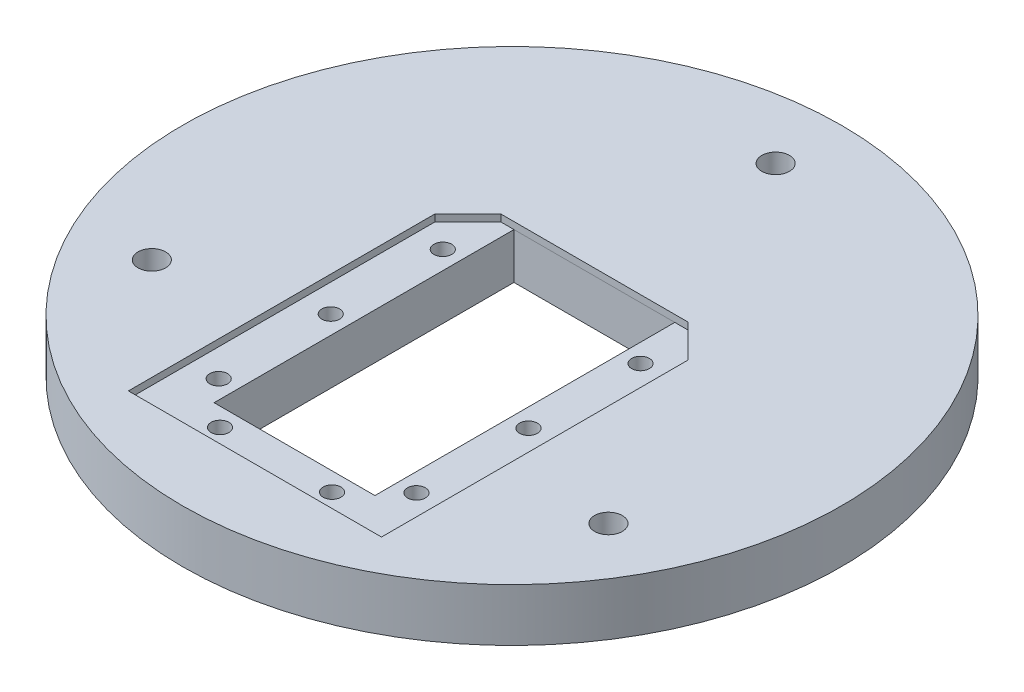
ISO-10303-21;
HEADER;
FILE_DESCRIPTION(('STEP AP214'),'2;1');
FILE_NAME('part.step','',(''),(''),'','','');
FILE_SCHEMA(('AUTOMOTIVE_DESIGN { 1 0 10303 214 1 1 1 1 }'));
ENDSEC;
DATA;
#1=APPLICATION_CONTEXT('core data for automotive mechanical design processes');
#2=APPLICATION_PROTOCOL_DEFINITION('international standard','automotive_design',2000,#1);
#3=PRODUCT_CONTEXT('',#1,'mechanical');
#4=PRODUCT('Part','Part','',(#3));
#5=PRODUCT_RELATED_PRODUCT_CATEGORY('part','',(#4));
#6=PRODUCT_DEFINITION_FORMATION('','',#4);
#7=PRODUCT_DEFINITION_CONTEXT('part definition',#1,'design');
#8=PRODUCT_DEFINITION('design','',#6,#7);
#9=PRODUCT_DEFINITION_SHAPE('','',#8);
#10=(LENGTH_UNIT() NAMED_UNIT(*) SI_UNIT(.MILLI.,.METRE.));
#11=(NAMED_UNIT(*) PLANE_ANGLE_UNIT() SI_UNIT($,.RADIAN.));
#12=(NAMED_UNIT(*) SI_UNIT($,.STERADIAN.) SOLID_ANGLE_UNIT());
#13=UNCERTAINTY_MEASURE_WITH_UNIT(LENGTH_MEASURE(1.E-05),#10,'distance_accuracy_value','');
#14=(GEOMETRIC_REPRESENTATION_CONTEXT(3) GLOBAL_UNCERTAINTY_ASSIGNED_CONTEXT((#13)) GLOBAL_UNIT_ASSIGNED_CONTEXT((#10,
#11,#12)) REPRESENTATION_CONTEXT('',''));
#15=CARTESIAN_POINT('',(0.,0.,0.));
#16=DIRECTION('',(0.,0.,1.));
#17=DIRECTION('',(1.,0.,0.));
#18=AXIS2_PLACEMENT_3D('',#15,#16,#17);
#19=CARTESIAN_POINT('',(-15.,10.,-4.50000000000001));
#20=DIRECTION('',(0.,-1.,0.));
#21=DIRECTION('',(0.,0.,-1.));
#22=AXIS2_PLACEMENT_3D('',#19,#20,#21);
#23=CYLINDRICAL_SURFACE('',#22,1.35000000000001);
#24=CARTESIAN_POINT('',(-15.,10.,-4.50000000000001));
#25=DIRECTION('',(0.,1.,0.));
#26=DIRECTION('',(0.,0.,1.));
#27=AXIS2_PLACEMENT_3D('',#24,#25,#26);
#28=CIRCLE('',#27,1.35000000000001);
#29=CARTESIAN_POINT('',(-15.,10.,-3.15));
#30=VERTEX_POINT('',#29);
#31=EDGE_CURVE('E162',#30,#30,#28,.T.);
#32=ORIENTED_EDGE('',*,*,#31,.T.);
#33=EDGE_LOOP('',(#32));
#34=FACE_BOUND('',#33,.T.);
#35=CARTESIAN_POINT('',(-15.,5.55,-4.50000000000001));
#36=DIRECTION('',(0.,-1.,0.));
#37=DIRECTION('',(0.,0.,-1.));
#38=AXIS2_PLACEMENT_3D('',#35,#36,#37);
#39=CIRCLE('',#38,1.35000000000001);
#40=CARTESIAN_POINT('',(-15.,5.55,-5.85000000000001));
#41=VERTEX_POINT('',#40);
#42=EDGE_CURVE('E38',#41,#41,#39,.T.);
#43=ORIENTED_EDGE('',*,*,#42,.T.);
#44=EDGE_LOOP('',(#43));
#45=FACE_BOUND('',#44,.T.);
#46=ADVANCED_FACE('F34',(#34,#45),#23,.F.);
#47=CARTESIAN_POINT('',(-15.,10.,12.5));
#48=DIRECTION('',(0.,-1.,0.));
#49=DIRECTION('',(0.,0.,-1.));
#50=AXIS2_PLACEMENT_3D('',#47,#48,#49);
#51=CYLINDRICAL_SURFACE('',#50,1.35000000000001);
#52=CARTESIAN_POINT('',(-15.,10.,12.5));
#53=DIRECTION('',(0.,1.,0.));
#54=DIRECTION('',(0.,0.,1.));
#55=AXIS2_PLACEMENT_3D('',#52,#53,#54);
#56=CIRCLE('',#55,1.35000000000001);
#57=CARTESIAN_POINT('',(-15.,10.,13.85));
#58=VERTEX_POINT('',#57);
#59=EDGE_CURVE('E159',#58,#58,#56,.T.);
#60=ORIENTED_EDGE('',*,*,#59,.T.);
#61=EDGE_LOOP('',(#60));
#62=FACE_BOUND('',#61,.T.);
#63=CARTESIAN_POINT('',(-15.,5.55,12.5));
#64=DIRECTION('',(0.,-1.,0.));
#65=DIRECTION('',(0.,0.,-1.));
#66=AXIS2_PLACEMENT_3D('',#63,#64,#65);
#67=CIRCLE('',#66,1.35000000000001);
#68=CARTESIAN_POINT('',(-15.,5.55,11.15));
#69=VERTEX_POINT('',#68);
#70=EDGE_CURVE('E499',#69,#69,#67,.T.);
#71=ORIENTED_EDGE('',*,*,#70,.T.);
#72=EDGE_LOOP('',(#71));
#73=FACE_BOUND('',#72,.T.);
#74=ADVANCED_FACE('F213',(#62,#73),#51,.F.);
#75=CARTESIAN_POINT('',(-15.,10.,29.5));
#76=DIRECTION('',(0.,-1.,0.));
#77=DIRECTION('',(0.,0.,-1.));
#78=AXIS2_PLACEMENT_3D('',#75,#76,#77);
#79=CYLINDRICAL_SURFACE('',#78,1.35000000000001);
#80=CARTESIAN_POINT('',(-15.,10.,29.5));
#81=DIRECTION('',(0.,1.,0.));
#82=DIRECTION('',(0.,0.,1.));
#83=AXIS2_PLACEMENT_3D('',#80,#81,#82);
#84=CIRCLE('',#83,1.35000000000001);
#85=CARTESIAN_POINT('',(-15.,10.,30.85));
#86=VERTEX_POINT('',#85);
#87=EDGE_CURVE('E156',#86,#86,#84,.T.);
#88=ORIENTED_EDGE('',*,*,#87,.T.);
#89=EDGE_LOOP('',(#88));
#90=FACE_BOUND('',#89,.T.);
#91=CARTESIAN_POINT('',(-15.,5.55,29.5));
#92=DIRECTION('',(0.,-1.,0.));
#93=DIRECTION('',(0.,0.,-1.));
#94=AXIS2_PLACEMENT_3D('',#91,#92,#93);
#95=CIRCLE('',#94,1.35000000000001);
#96=CARTESIAN_POINT('',(-15.,5.55,28.15));
#97=VERTEX_POINT('',#96);
#98=EDGE_CURVE('E505',#97,#97,#95,.T.);
#99=ORIENTED_EDGE('',*,*,#98,.T.);
#100=EDGE_LOOP('',(#99));
#101=FACE_BOUND('',#100,.T.);
#102=ADVANCED_FACE('F209',(#90,#101),#79,.F.);
#103=CARTESIAN_POINT('',(-8.50000000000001,10.,35.8));
#104=DIRECTION('',(0.,-1.,0.));
#105=DIRECTION('',(0.,0.,-1.));
#106=AXIS2_PLACEMENT_3D('',#103,#104,#105);
#107=CYLINDRICAL_SURFACE('',#106,1.34999999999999);
#108=CARTESIAN_POINT('',(-8.50000000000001,10.,35.8));
#109=DIRECTION('',(0.,1.,0.));
#110=DIRECTION('',(0.,0.,1.));
#111=AXIS2_PLACEMENT_3D('',#108,#109,#110);
#112=CIRCLE('',#111,1.34999999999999);
#113=CARTESIAN_POINT('',(-8.50000000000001,10.,37.15));
#114=VERTEX_POINT('',#113);
#115=EDGE_CURVE('E153',#114,#114,#112,.T.);
#116=ORIENTED_EDGE('',*,*,#115,.T.);
#117=EDGE_LOOP('',(#116));
#118=FACE_BOUND('',#117,.T.);
#119=CARTESIAN_POINT('',(-8.50000000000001,5.55,35.8));
#120=DIRECTION('',(0.,-1.,0.));
#121=DIRECTION('',(0.,0.,-1.));
#122=AXIS2_PLACEMENT_3D('',#119,#120,#121);
#123=CIRCLE('',#122,1.34999999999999);
#124=CARTESIAN_POINT('',(-8.50000000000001,5.55,34.45));
#125=VERTEX_POINT('',#124);
#126=EDGE_CURVE('E512',#125,#125,#123,.T.);
#127=ORIENTED_EDGE('',*,*,#126,.T.);
#128=EDGE_LOOP('',(#127));
#129=FACE_BOUND('',#128,.T.);
#130=ADVANCED_FACE('F205',(#118,#129),#107,.F.);
#131=CARTESIAN_POINT('',(8.50000000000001,10.,35.8));
#132=DIRECTION('',(0.,-1.,0.));
#133=DIRECTION('',(0.,0.,-1.));
#134=AXIS2_PLACEMENT_3D('',#131,#132,#133);
#135=CYLINDRICAL_SURFACE('',#134,1.34999999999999);
#136=CARTESIAN_POINT('',(8.50000000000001,10.,35.8));
#137=DIRECTION('',(0.,1.,0.));
#138=DIRECTION('',(0.,0.,1.));
#139=AXIS2_PLACEMENT_3D('',#136,#137,#138);
#140=CIRCLE('',#139,1.34999999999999);
#141=CARTESIAN_POINT('',(8.50000000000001,10.,37.15));
#142=VERTEX_POINT('',#141);
#143=EDGE_CURVE('E150',#142,#142,#140,.T.);
#144=ORIENTED_EDGE('',*,*,#143,.T.);
#145=EDGE_LOOP('',(#144));
#146=FACE_BOUND('',#145,.T.);
#147=CARTESIAN_POINT('',(8.50000000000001,5.55,35.8));
#148=DIRECTION('',(0.,-1.,0.));
#149=DIRECTION('',(0.,0.,-1.));
#150=AXIS2_PLACEMENT_3D('',#147,#148,#149);
#151=CIRCLE('',#150,1.34999999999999);
#152=CARTESIAN_POINT('',(8.50000000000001,5.55,34.45));
#153=VERTEX_POINT('',#152);
#154=EDGE_CURVE('E519',#153,#153,#151,.T.);
#155=ORIENTED_EDGE('',*,*,#154,.T.);
#156=EDGE_LOOP('',(#155));
#157=FACE_BOUND('',#156,.T.);
#158=ADVANCED_FACE('F193',(#146,#157),#135,.F.);
#159=CARTESIAN_POINT('',(15.,10.,-4.50000000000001));
#160=DIRECTION('',(0.,-1.,0.));
#161=DIRECTION('',(0.,0.,-1.));
#162=AXIS2_PLACEMENT_3D('',#159,#160,#161);
#163=CYLINDRICAL_SURFACE('',#162,1.34999999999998);
#164=CARTESIAN_POINT('',(15.,10.,-4.50000000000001));
#165=DIRECTION('',(0.,1.,0.));
#166=DIRECTION('',(0.,0.,1.));
#167=AXIS2_PLACEMENT_3D('',#164,#165,#166);
#168=CIRCLE('',#167,1.34999999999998);
#169=CARTESIAN_POINT('',(15.,10.,-3.15000000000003));
#170=VERTEX_POINT('',#169);
#171=EDGE_CURVE('E141',#170,#170,#168,.T.);
#172=ORIENTED_EDGE('',*,*,#171,.T.);
#173=EDGE_LOOP('',(#172));
#174=FACE_BOUND('',#173,.T.);
#175=CARTESIAN_POINT('',(15.,5.55,-4.50000000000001));
#176=DIRECTION('',(0.,-1.,0.));
#177=DIRECTION('',(0.,0.,-1.));
#178=AXIS2_PLACEMENT_3D('',#175,#176,#177);
#179=CIRCLE('',#178,1.34999999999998);
#180=CARTESIAN_POINT('',(15.,5.55,-5.84999999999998));
#181=VERTEX_POINT('',#180);
#182=EDGE_CURVE('E526',#181,#181,#179,.T.);
#183=ORIENTED_EDGE('',*,*,#182,.T.);
#184=EDGE_LOOP('',(#183));
#185=FACE_BOUND('',#184,.T.);
#186=ADVANCED_FACE('F189',(#174,#185),#163,.F.);
#187=CARTESIAN_POINT('',(15.,10.,12.5));
#188=DIRECTION('',(0.,-1.,0.));
#189=DIRECTION('',(0.,0.,-1.));
#190=AXIS2_PLACEMENT_3D('',#187,#188,#189);
#191=CYLINDRICAL_SURFACE('',#190,1.34999999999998);
#192=CARTESIAN_POINT('',(15.,10.,12.5));
#193=DIRECTION('',(0.,1.,0.));
#194=DIRECTION('',(0.,0.,1.));
#195=AXIS2_PLACEMENT_3D('',#192,#193,#194);
#196=CIRCLE('',#195,1.34999999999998);
#197=CARTESIAN_POINT('',(15.,10.,13.85));
#198=VERTEX_POINT('',#197);
#199=EDGE_CURVE('E144',#198,#198,#196,.T.);
#200=ORIENTED_EDGE('',*,*,#199,.T.);
#201=EDGE_LOOP('',(#200));
#202=FACE_BOUND('',#201,.T.);
#203=CARTESIAN_POINT('',(15.,5.55,12.5));
#204=DIRECTION('',(0.,-1.,0.));
#205=DIRECTION('',(0.,0.,-1.));
#206=AXIS2_PLACEMENT_3D('',#203,#204,#205);
#207=CIRCLE('',#206,1.34999999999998);
#208=CARTESIAN_POINT('',(15.,5.55,11.15));
#209=VERTEX_POINT('',#208);
#210=EDGE_CURVE('E533',#209,#209,#207,.T.);
#211=ORIENTED_EDGE('',*,*,#210,.T.);
#212=EDGE_LOOP('',(#211));
#213=FACE_BOUND('',#212,.T.);
#214=ADVANCED_FACE('F192',(#202,#213),#191,.F.);
#215=CARTESIAN_POINT('',(15.,10.,29.5));
#216=DIRECTION('',(0.,-1.,0.));
#217=DIRECTION('',(0.,0.,-1.));
#218=AXIS2_PLACEMENT_3D('',#215,#216,#217);
#219=CYLINDRICAL_SURFACE('',#218,1.34999999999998);
#220=CARTESIAN_POINT('',(15.,10.,29.5));
#221=DIRECTION('',(0.,1.,0.));
#222=DIRECTION('',(0.,0.,1.));
#223=AXIS2_PLACEMENT_3D('',#220,#221,#222);
#224=CIRCLE('',#223,1.34999999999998);
#225=CARTESIAN_POINT('',(15.,10.,30.85));
#226=VERTEX_POINT('',#225);
#227=EDGE_CURVE('E147',#226,#226,#224,.T.);
#228=ORIENTED_EDGE('',*,*,#227,.T.);
#229=EDGE_LOOP('',(#228));
#230=FACE_BOUND('',#229,.T.);
#231=CARTESIAN_POINT('',(15.,5.55,29.5));
#232=DIRECTION('',(0.,-1.,0.));
#233=DIRECTION('',(0.,0.,-1.));
#234=AXIS2_PLACEMENT_3D('',#231,#232,#233);
#235=CIRCLE('',#234,1.34999999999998);
#236=CARTESIAN_POINT('',(15.,5.55,28.15));
#237=VERTEX_POINT('',#236);
#238=EDGE_CURVE('E540',#237,#237,#235,.T.);
#239=ORIENTED_EDGE('',*,*,#238,.T.);
#240=EDGE_LOOP('',(#239));
#241=FACE_BOUND('',#240,.T.);
#242=ADVANCED_FACE('F197',(#230,#241),#219,.F.);
#243=CARTESIAN_POINT('',(0.,11.05,0.));
#244=DIRECTION('',(0.,1.,0.));
#245=DIRECTION('',(0.,0.,1.));
#246=AXIS2_PLACEMENT_3D('',#243,#244,#245);
#247=PLANE('',#246);
#248=DIRECTION('',(-0.70710678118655,0.,0.707106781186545));
#249=VECTOR('',#248,1.);
#250=CARTESIAN_POINT('',(-14.1998377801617,11.05,-12.4997508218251));
#251=LINE('',#250,#249);
#252=CARTESIAN_POINT('',(-19.1998377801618,11.05,-7.4997508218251));
#253=VERTEX_POINT('',#252);
#254=CARTESIAN_POINT('',(-14.1998377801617,11.05,-12.4997508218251));
#255=VERTEX_POINT('',#254);
#256=EDGE_CURVE('E240',#253,#255,#251,.F.);
#257=ORIENTED_EDGE('',*,*,#256,.T.);
#258=DIRECTION('',(-1.,0.,0.));
#259=VECTOR('',#258,1.);
#260=CARTESIAN_POINT('',(-19.1998377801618,11.05,-12.4997508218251));
#261=LINE('',#260,#259);
#262=CARTESIAN_POINT('',(14.2001622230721,11.05,-12.4997508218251));
#263=VERTEX_POINT('',#262);
#264=EDGE_CURVE('E58',#263,#255,#261,.T.);
#265=ORIENTED_EDGE('',*,*,#264,.F.);
#266=DIRECTION('',(-0.707106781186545,0.,-0.70710678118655));
#267=VECTOR('',#266,1.);
#268=CARTESIAN_POINT('',(19.200162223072,11.05,-7.49975082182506));
#269=LINE('',#268,#267);
#270=CARTESIAN_POINT('',(19.200162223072,11.05,-7.49975082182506));
#271=VERTEX_POINT('',#270);
#272=EDGE_CURVE('E11',#263,#271,#269,.F.);
#273=ORIENTED_EDGE('',*,*,#272,.T.);
#274=DIRECTION('',(0.,0.,-1.));
#275=VECTOR('',#274,1.);
#276=CARTESIAN_POINT('',(19.200162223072,11.05,-12.4997508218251));
#277=LINE('',#276,#275);
#278=CARTESIAN_POINT('',(19.2001622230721,11.05,39.0002491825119));
#279=VERTEX_POINT('',#278);
#280=EDGE_CURVE('E317',#279,#271,#277,.T.);
#281=ORIENTED_EDGE('',*,*,#280,.F.);
#282=DIRECTION('',(1.,0.,0.));
#283=VECTOR('',#282,1.);
#284=CARTESIAN_POINT('',(-19.1998377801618,11.05,39.0002491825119));
#285=LINE('',#284,#283);
#286=CARTESIAN_POINT('',(-19.1998377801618,11.05,39.0002491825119));
#287=VERTEX_POINT('',#286);
#288=EDGE_CURVE('E321',#287,#279,#285,.T.);
#289=ORIENTED_EDGE('',*,*,#288,.F.);
#290=DIRECTION('',(0.,0.,1.));
#291=VECTOR('',#290,1.);
#292=CARTESIAN_POINT('',(-19.1998377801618,11.05,-12.4997508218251));
#293=LINE('',#292,#291);
#294=EDGE_CURVE('E246',#253,#287,#293,.T.);
#295=ORIENTED_EDGE('',*,*,#294,.F.);
#296=EDGE_LOOP('',(#257,#265,#273,#281,#289,#295));
#297=FACE_BOUND('',#296,.T.);
#298=CARTESIAN_POINT('',(-34.640259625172,11.05,20.0048353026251));
#299=DIRECTION('',(0.,-1.,0.));
#300=DIRECTION('',(0.,0.,-1.));
#301=AXIS2_PLACEMENT_3D('',#298,#299,#300);
#302=CIRCLE('',#301,2.1);
#303=CARTESIAN_POINT('',(-34.640259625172,11.05,17.9048353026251));
#304=VERTEX_POINT('',#303);
#305=EDGE_CURVE('E324',#304,#304,#302,.T.);
#306=ORIENTED_EDGE('',*,*,#305,.T.);
#307=EDGE_LOOP('',(#306));
#308=FACE_BOUND('',#307,.T.);
#309=CARTESIAN_POINT('',(34.63707466,11.05,20.0031329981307));
#310=DIRECTION('',(0.,-1.,0.));
#311=DIRECTION('',(0.,0.,-1.));
#312=AXIS2_PLACEMENT_3D('',#309,#310,#311);
#313=CIRCLE('',#312,2.1);
#314=CARTESIAN_POINT('',(34.63707466,11.05,17.9031329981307));
#315=VERTEX_POINT('',#314);
#316=EDGE_CURVE('E560',#315,#315,#313,.T.);
#317=ORIENTED_EDGE('',*,*,#316,.T.);
#318=EDGE_LOOP('',(#317));
#319=FACE_BOUND('',#318,.T.);
#320=CARTESIAN_POINT('',(0.001000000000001,11.05,-39.9957743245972));
#321=DIRECTION('',(0.,-1.,0.));
#322=DIRECTION('',(0.,0.,-1.));
#323=AXIS2_PLACEMENT_3D('',#320,#321,#322);
#324=CIRCLE('',#323,2.1);
#325=CARTESIAN_POINT('',(0.001000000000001,11.05,-42.0957743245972));
#326=VERTEX_POINT('',#325);
#327=EDGE_CURVE('E264',#326,#326,#324,.T.);
#328=ORIENTED_EDGE('',*,*,#327,.T.);
#329=EDGE_LOOP('',(#328));
#330=FACE_BOUND('',#329,.T.);
#331=CARTESIAN_POINT('',(0.,11.05,0.));
#332=DIRECTION('',(0.,1.,0.));
#333=DIRECTION('',(0.,0.,1.));
#334=AXIS2_PLACEMENT_3D('',#331,#332,#333);
#335=CIRCLE('',#334,50.);
#336=CARTESIAN_POINT('',(0.,11.05,50.));
#337=VERTEX_POINT('',#336);
#338=EDGE_CURVE('E544',#337,#337,#335,.T.);
#339=ORIENTED_EDGE('',*,*,#338,.T.);
#340=EDGE_LOOP('',(#339));
#341=FACE_BOUND('',#340,.T.);
#342=ADVANCED_FACE('F201',(#297,#308,#319,#330,#341),#247,.T.);
#343=CARTESIAN_POINT('',(0.,3.05,0.));
#344=DIRECTION('',(0.,-1.,0.));
#345=DIRECTION('',(0.,0.,-1.));
#346=AXIS2_PLACEMENT_3D('',#343,#344,#345);
#347=PLANE('',#346);
#348=CARTESIAN_POINT('',(-14.9995587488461,3.05,-4.49999999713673));
#349=DIRECTION('',(0.,-1.,0.));
#350=DIRECTION('',(0.,0.,-1.));
#351=AXIS2_PLACEMENT_3D('',#348,#349,#350);
#352=CIRCLE('',#351,2.25);
#353=CARTESIAN_POINT('',(-14.9995587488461,3.05,-6.74999999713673));
#354=VERTEX_POINT('',#353);
#355=EDGE_CURVE('E490',#354,#354,#352,.T.);
#356=ORIENTED_EDGE('',*,*,#355,.F.);
#357=EDGE_LOOP('',(#356));
#358=FACE_BOUND('',#357,.T.);
#359=CARTESIAN_POINT('',(-14.999779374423,3.05,12.5000000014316));
#360=DIRECTION('',(0.,-1.,0.));
#361=DIRECTION('',(0.,0.,-1.));
#362=AXIS2_PLACEMENT_3D('',#359,#360,#361);
#363=CIRCLE('',#362,2.25);
#364=CARTESIAN_POINT('',(-14.999779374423,3.05,10.2500000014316));
#365=VERTEX_POINT('',#364);
#366=EDGE_CURVE('E492',#365,#365,#363,.T.);
#367=ORIENTED_EDGE('',*,*,#366,.F.);
#368=EDGE_LOOP('',(#367));
#369=FACE_BOUND('',#368,.T.);
#370=CARTESIAN_POINT('',(-15.,3.05,29.5));
#371=DIRECTION('',(0.,-1.,0.));
#372=DIRECTION('',(0.,0.,-1.));
#373=AXIS2_PLACEMENT_3D('',#370,#371,#372);
#374=CIRCLE('',#373,2.25);
#375=CARTESIAN_POINT('',(-15.,3.05,27.25));
#376=VERTEX_POINT('',#375);
#377=EDGE_CURVE('E506',#376,#376,#374,.T.);
#378=ORIENTED_EDGE('',*,*,#377,.F.);
#379=EDGE_LOOP('',(#378));
#380=FACE_BOUND('',#379,.T.);
#381=CARTESIAN_POINT('',(-8.50000000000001,3.05,35.8));
#382=DIRECTION('',(0.,-1.,0.));
#383=DIRECTION('',(0.,0.,-1.));
#384=AXIS2_PLACEMENT_3D('',#381,#382,#383);
#385=CIRCLE('',#384,2.25);
#386=CARTESIAN_POINT('',(-8.50000000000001,3.05,33.55));
#387=VERTEX_POINT('',#386);
#388=EDGE_CURVE('E513',#387,#387,#385,.T.);
#389=ORIENTED_EDGE('',*,*,#388,.F.);
#390=EDGE_LOOP('',(#389));
#391=FACE_BOUND('',#390,.T.);
#392=CARTESIAN_POINT('',(8.50000000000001,3.05,35.8));
#393=DIRECTION('',(0.,-1.,0.));
#394=DIRECTION('',(0.,0.,-1.));
#395=AXIS2_PLACEMENT_3D('',#392,#393,#394);
#396=CIRCLE('',#395,2.25);
#397=CARTESIAN_POINT('',(8.50000000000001,3.05,33.55));
#398=VERTEX_POINT('',#397);
#399=EDGE_CURVE('E520',#398,#398,#396,.T.);
#400=ORIENTED_EDGE('',*,*,#399,.F.);
#401=EDGE_LOOP('',(#400));
#402=FACE_BOUND('',#401,.T.);
#403=CARTESIAN_POINT('',(15.0004412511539,3.05,-4.49999999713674));
#404=DIRECTION('',(0.,-1.,0.));
#405=DIRECTION('',(0.,0.,-1.));
#406=AXIS2_PLACEMENT_3D('',#403,#404,#405);
#407=CIRCLE('',#406,2.25);
#408=CARTESIAN_POINT('',(15.0004412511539,3.05,-6.74999999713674));
#409=VERTEX_POINT('',#408);
#410=EDGE_CURVE('E527',#409,#409,#407,.T.);
#411=ORIENTED_EDGE('',*,*,#410,.F.);
#412=EDGE_LOOP('',(#411));
#413=FACE_BOUND('',#412,.T.);
#414=CARTESIAN_POINT('',(15.000220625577,3.05,12.5000000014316));
#415=DIRECTION('',(0.,-1.,0.));
#416=DIRECTION('',(0.,0.,-1.));
#417=AXIS2_PLACEMENT_3D('',#414,#415,#416);
#418=CIRCLE('',#417,2.25);
#419=CARTESIAN_POINT('',(15.000220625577,3.05,10.2500000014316));
#420=VERTEX_POINT('',#419);
#421=EDGE_CURVE('E534',#420,#420,#418,.T.);
#422=ORIENTED_EDGE('',*,*,#421,.F.);
#423=EDGE_LOOP('',(#422));
#424=FACE_BOUND('',#423,.T.);
#425=CARTESIAN_POINT('',(15.,3.05,29.5));
#426=DIRECTION('',(0.,-1.,0.));
#427=DIRECTION('',(0.,0.,-1.));
#428=AXIS2_PLACEMENT_3D('',#425,#426,#427);
#429=CIRCLE('',#428,2.25);
#430=CARTESIAN_POINT('',(15.,3.05,27.25));
#431=VERTEX_POINT('',#430);
#432=EDGE_CURVE('E541',#431,#431,#429,.T.);
#433=ORIENTED_EDGE('',*,*,#432,.F.);
#434=EDGE_LOOP('',(#433));
#435=FACE_BOUND('',#434,.T.);
#436=CARTESIAN_POINT('',(34.63707466,3.05,20.0031329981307));
#437=DIRECTION('',(0.,-1.,0.));
#438=DIRECTION('',(0.,0.,-1.));
#439=AXIS2_PLACEMENT_3D('',#436,#437,#438);
#440=CIRCLE('',#439,4.00000000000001);
#441=CARTESIAN_POINT('',(34.63707466,3.05,16.0031329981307));
#442=VERTEX_POINT('',#441);
#443=EDGE_CURVE('E118',#442,#442,#440,.F.);
#444=ORIENTED_EDGE('',*,*,#443,.T.);
#445=EDGE_LOOP('',(#444));
#446=FACE_BOUND('',#445,.T.);
#447=CARTESIAN_POINT('',(0.001000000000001,3.05,-39.9957743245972));
#448=DIRECTION('',(0.,-1.,0.));
#449=DIRECTION('',(0.,0.,-1.));
#450=AXIS2_PLACEMENT_3D('',#447,#448,#449);
#451=CIRCLE('',#450,4.);
#452=CARTESIAN_POINT('',(0.001000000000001,3.05,-43.9957743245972));
#453=VERTEX_POINT('',#452);
#454=EDGE_CURVE('E274',#453,#453,#451,.F.);
#455=ORIENTED_EDGE('',*,*,#454,.T.);
#456=EDGE_LOOP('',(#455));
#457=FACE_BOUND('',#456,.T.);
#458=CARTESIAN_POINT('',(-34.640259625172,3.05,20.0048353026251));
#459=DIRECTION('',(0.,-1.,0.));
#460=DIRECTION('',(0.,0.,-1.));
#461=AXIS2_PLACEMENT_3D('',#458,#459,#460);
#462=CIRCLE('',#461,4.);
#463=CARTESIAN_POINT('',(-34.640259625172,3.05,16.0048353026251));
#464=VERTEX_POINT('',#463);
#465=EDGE_CURVE('E276',#464,#464,#462,.F.);
#466=ORIENTED_EDGE('',*,*,#465,.T.);
#467=EDGE_LOOP('',(#466));
#468=FACE_BOUND('',#467,.T.);
#469=DIRECTION('',(-0.999999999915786,0.,-1.29779751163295E-05));
#470=VECTOR('',#469,1.);
#471=CARTESIAN_POINT('',(12.2001622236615,3.05,-12.4998416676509));
#472=LINE('',#471,#470);
#473=CARTESIAN_POINT('',(12.2001622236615,3.05,-12.4998416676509));
#474=VERTEX_POINT('',#473);
#475=CARTESIAN_POINT('',(-12.1998377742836,3.05,-12.5001583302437));
#476=VERTEX_POINT('',#475);
#477=EDGE_CURVE('E51',#474,#476,#472,.T.);
#478=ORIENTED_EDGE('',*,*,#477,.T.);
#479=DIRECTION('',(-1.2977975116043E-05,0.,0.999999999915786));
#480=VECTOR('',#479,1.);
#481=CARTESIAN_POINT('',(-12.1998377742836,3.05,-12.5001583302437));
#482=LINE('',#481,#480);
#483=CARTESIAN_POINT('',(-12.2004282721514,3.05,32.9998416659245));
#484=VERTEX_POINT('',#483);
#485=EDGE_CURVE('E109',#476,#484,#482,.T.);
#486=ORIENTED_EDGE('',*,*,#485,.T.);
#487=DIRECTION('',(0.999999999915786,0.,1.2977975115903E-05));
#488=VECTOR('',#487,1.);
#489=CARTESIAN_POINT('',(-12.2004282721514,3.05,32.9998416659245));
#490=LINE('',#489,#488);
#491=CARTESIAN_POINT('',(12.1995717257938,3.05,33.0001583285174));
#492=VERTEX_POINT('',#491);
#493=EDGE_CURVE('E113',#484,#492,#490,.T.);
#494=ORIENTED_EDGE('',*,*,#493,.T.);
#495=DIRECTION('',(1.29779751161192E-05,0.,-0.999999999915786));
#496=VECTOR('',#495,1.);
#497=CARTESIAN_POINT('',(12.1995717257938,3.05,33.0001583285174));
#498=LINE('',#497,#496);
#499=EDGE_CURVE('E127',#492,#474,#498,.T.);
#500=ORIENTED_EDGE('',*,*,#499,.T.);
#501=EDGE_LOOP('',(#478,#486,#494,#500));
#502=FACE_BOUND('',#501,.T.);
#503=CARTESIAN_POINT('',(0.,3.05,0.));
#504=DIRECTION('',(0.,-1.,0.));
#505=DIRECTION('',(0.,0.,-1.));
#506=AXIS2_PLACEMENT_3D('',#503,#504,#505);
#507=CIRCLE('',#506,50.);
#508=CARTESIAN_POINT('',(0.,3.05,-50.));
#509=VERTEX_POINT('',#508);
#510=EDGE_CURVE('E277',#509,#509,#507,.T.);
#511=ORIENTED_EDGE('',*,*,#510,.T.);
#512=EDGE_LOOP('',(#511));
#513=FACE_BOUND('',#512,.T.);
#514=ADVANCED_FACE('F111',(#358,#369,#380,#391,#402,#413,#424,#435,#446,#457,#468,#502,#513),
#347,.T.);
#515=CARTESIAN_POINT('',(12.2001622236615,2.,-12.4998416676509));
#516=DIRECTION('',(1.29779751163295E-05,0.,-0.999999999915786));
#517=DIRECTION('',(-0.999999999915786,0.,-1.29779751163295E-05));
#518=AXIS2_PLACEMENT_3D('',#515,#516,#517);
#519=PLANE('',#518);
#520=ORIENTED_EDGE('',*,*,#477,.F.);
#521=DIRECTION('',(0.,1.,0.));
#522=VECTOR('',#521,1.);
#523=CARTESIAN_POINT('',(12.2001622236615,2.,-12.4998416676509));
#524=LINE('',#523,#522);
#525=CARTESIAN_POINT('',(12.2001622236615,10.,-12.499796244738));
#526=VERTEX_POINT('',#525);
#527=EDGE_CURVE('E135',#474,#526,#524,.T.);
#528=ORIENTED_EDGE('',*,*,#527,.T.);
#529=CARTESIAN_POINT('',(12.2001622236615,10.,-12.4998416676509));
#530=DIRECTION('',(-0.999999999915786,0.,-1.29779751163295E-05));
#531=VECTOR('',#530,1.);
#532=LINE('',#529,#531);
#533=CARTESIAN_POINT('',(-12.1998377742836,10.,-12.4999545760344));
#534=VERTEX_POINT('',#533);
#535=EDGE_CURVE('E170',#526,#534,#532,.T.);
#536=ORIENTED_EDGE('',*,*,#535,.T.);
#537=DIRECTION('',(0.,1.,0.));
#538=VECTOR('',#537,1.);
#539=CARTESIAN_POINT('',(-12.1998377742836,2.,-12.5001583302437));
#540=LINE('',#539,#538);
#541=EDGE_CURVE('E133',#476,#534,#540,.T.);
#542=ORIENTED_EDGE('',*,*,#541,.F.);
#543=EDGE_LOOP('',(#520,#528,#536,#542));
#544=FACE_BOUND('',#543,.T.);
#545=ADVANCED_FACE('F177',(#544),#519,.F.);
#546=CARTESIAN_POINT('',(12.1995717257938,2.,33.0001583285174));
#547=DIRECTION('',(0.999999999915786,0.,1.29779751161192E-05));
#548=DIRECTION('',(1.29779751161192E-05,0.,-0.999999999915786));
#549=AXIS2_PLACEMENT_3D('',#546,#547,#548);
#550=PLANE('',#549);
#551=ORIENTED_EDGE('',*,*,#499,.F.);
#552=DIRECTION('',(0.,1.,0.));
#553=VECTOR('',#552,1.);
#554=CARTESIAN_POINT('',(12.1995717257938,2.,33.0001583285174));
#555=LINE('',#554,#553);
#556=CARTESIAN_POINT('',(12.1995717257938,10.,33.0001583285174));
#557=VERTEX_POINT('',#556);
#558=EDGE_CURVE('E126',#492,#557,#555,.T.);
#559=ORIENTED_EDGE('',*,*,#558,.T.);
#560=DIRECTION('',(1.29779751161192E-05,0.,-0.999999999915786));
#561=VECTOR('',#560,1.);
#562=CARTESIAN_POINT('',(12.1995717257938,10.,33.0001583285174));
#563=LINE('',#562,#561);
#564=EDGE_CURVE('E137',#557,#526,#563,.T.);
#565=ORIENTED_EDGE('',*,*,#564,.T.);
#566=ORIENTED_EDGE('',*,*,#527,.F.);
#567=EDGE_LOOP('',(#551,#559,#565,#566));
#568=FACE_BOUND('',#567,.T.);
#569=ADVANCED_FACE('F187',(#568),#550,.F.);
#570=CARTESIAN_POINT('',(-12.2004282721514,2.,32.9998416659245));
#571=DIRECTION('',(-1.2977975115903E-05,0.,0.999999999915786));
#572=DIRECTION('',(0.999999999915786,0.,1.2977975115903E-05));
#573=AXIS2_PLACEMENT_3D('',#570,#571,#572);
#574=PLANE('',#573);
#575=ORIENTED_EDGE('',*,*,#493,.F.);
#576=DIRECTION('',(0.,1.,0.));
#577=VECTOR('',#576,1.);
#578=CARTESIAN_POINT('',(-12.2004282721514,2.,32.9998416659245));
#579=LINE('',#578,#577);
#580=CARTESIAN_POINT('',(-12.2004282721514,10.,32.9998416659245));
#581=VERTEX_POINT('',#580);
#582=EDGE_CURVE('E124',#484,#581,#579,.T.);
#583=ORIENTED_EDGE('',*,*,#582,.T.);
#584=DIRECTION('',(0.999999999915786,0.,1.2977975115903E-05));
#585=VECTOR('',#584,1.);
#586=CARTESIAN_POINT('',(-12.2004282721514,10.,32.9998416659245));
#587=LINE('',#586,#585);
#588=EDGE_CURVE('E286',#581,#557,#587,.T.);
#589=ORIENTED_EDGE('',*,*,#588,.T.);
#590=ORIENTED_EDGE('',*,*,#558,.F.);
#591=EDGE_LOOP('',(#575,#583,#589,#590));
#592=FACE_BOUND('',#591,.T.);
#593=ADVANCED_FACE('F122',(#592),#574,.F.);
#594=CARTESIAN_POINT('',(-12.1998377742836,2.,-12.5001583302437));
#595=DIRECTION('',(-0.999999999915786,0.,-1.2977975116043E-05));
#596=DIRECTION('',(-1.2977975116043E-05,0.,0.999999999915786));
#597=AXIS2_PLACEMENT_3D('',#594,#595,#596);
#598=PLANE('',#597);
#599=ORIENTED_EDGE('',*,*,#485,.F.);
#600=ORIENTED_EDGE('',*,*,#541,.T.);
#601=DIRECTION('',(-1.2977975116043E-05,0.,0.999999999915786));
#602=VECTOR('',#601,1.);
#603=CARTESIAN_POINT('',(-12.1998377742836,10.,-12.5001583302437));
#604=LINE('',#603,#602);
#605=EDGE_CURVE('E131',#534,#581,#604,.T.);
#606=ORIENTED_EDGE('',*,*,#605,.T.);
#607=ORIENTED_EDGE('',*,*,#582,.F.);
#608=EDGE_LOOP('',(#599,#600,#606,#607));
#609=FACE_BOUND('',#608,.T.);
#610=ADVANCED_FACE('F129',(#609),#598,.F.);
#611=CARTESIAN_POINT('',(34.63707466,7.05,20.0031329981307));
#612=DIRECTION('',(0.,-1.,0.));
#613=DIRECTION('',(0.,0.,-1.));
#614=AXIS2_PLACEMENT_3D('',#611,#612,#613);
#615=CYLINDRICAL_SURFACE('',#614,4.00000000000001);
#616=CARTESIAN_POINT('',(34.63707466,7.05,20.0031329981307));
#617=DIRECTION('',(0.,-1.,0.));
#618=DIRECTION('',(0.,0.,-1.));
#619=AXIS2_PLACEMENT_3D('',#616,#617,#618);
#620=CIRCLE('',#619,4.00000000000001);
#621=CARTESIAN_POINT('',(34.63707466,7.05,16.0031329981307));
#622=VERTEX_POINT('',#621);
#623=EDGE_CURVE('E265',#622,#622,#620,.T.);
#624=CARTESIAN_POINT('',(34.63707466,7.05,16.0031329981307));
#625=CARTESIAN_POINT('',(34.63707466,7.00833333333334,16.0031329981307));
#626=CARTESIAN_POINT('',(34.63707466,6.96666666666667,16.0031329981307));
#627=CARTESIAN_POINT('',(34.63707466,6.88333333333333,16.0031329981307));
#628=CARTESIAN_POINT('',(34.63707466,6.84166666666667,16.0031329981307));
#629=CARTESIAN_POINT('',(34.63707466,6.75833333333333,16.0031329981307));
#630=CARTESIAN_POINT('',(34.63707466,6.71666666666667,16.0031329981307));
#631=CARTESIAN_POINT('',(34.63707466,6.63333333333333,16.0031329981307));
#632=CARTESIAN_POINT('',(34.63707466,6.59166666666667,16.0031329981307));
#633=CARTESIAN_POINT('',(34.63707466,6.50833333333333,16.0031329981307));
#634=CARTESIAN_POINT('',(34.63707466,6.46666666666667,16.0031329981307));
#635=CARTESIAN_POINT('',(34.63707466,6.38333333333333,16.0031329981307));
#636=CARTESIAN_POINT('',(34.63707466,6.34166666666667,16.0031329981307));
#637=CARTESIAN_POINT('',(34.63707466,6.25833333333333,16.0031329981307));
#638=CARTESIAN_POINT('',(34.63707466,6.21666666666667,16.0031329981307));
#639=CARTESIAN_POINT('',(34.63707466,6.13333333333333,16.0031329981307));
#640=CARTESIAN_POINT('',(34.63707466,6.09166666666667,16.0031329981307));
#641=CARTESIAN_POINT('',(34.63707466,6.00833333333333,16.0031329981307));
#642=CARTESIAN_POINT('',(34.63707466,5.96666666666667,16.0031329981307));
#643=CARTESIAN_POINT('',(34.63707466,5.88333333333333,16.0031329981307));
#644=CARTESIAN_POINT('',(34.63707466,5.84166666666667,16.0031329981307));
#645=CARTESIAN_POINT('',(34.63707466,5.75833333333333,16.0031329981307));
#646=CARTESIAN_POINT('',(34.63707466,5.71666666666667,16.0031329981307));
#647=CARTESIAN_POINT('',(34.63707466,5.63333333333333,16.0031329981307));
#648=CARTESIAN_POINT('',(34.63707466,5.59166666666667,16.0031329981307));
#649=CARTESIAN_POINT('',(34.63707466,5.50833333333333,16.0031329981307));
#650=CARTESIAN_POINT('',(34.63707466,5.46666666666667,16.0031329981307));
#651=CARTESIAN_POINT('',(34.63707466,5.38333333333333,16.0031329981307));
#652=CARTESIAN_POINT('',(34.63707466,5.34166666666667,16.0031329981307));
#653=CARTESIAN_POINT('',(34.63707466,5.25833333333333,16.0031329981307));
#654=CARTESIAN_POINT('',(34.63707466,5.21666666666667,16.0031329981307));
#655=CARTESIAN_POINT('',(34.63707466,5.13333333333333,16.0031329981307));
#656=CARTESIAN_POINT('',(34.63707466,5.09166666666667,16.0031329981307));
#657=CARTESIAN_POINT('',(34.63707466,5.00833333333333,16.0031329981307));
#658=CARTESIAN_POINT('',(34.63707466,4.96666666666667,16.0031329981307));
#659=CARTESIAN_POINT('',(34.63707466,4.88333333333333,16.0031329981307));
#660=CARTESIAN_POINT('',(34.63707466,4.84166666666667,16.0031329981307));
#661=CARTESIAN_POINT('',(34.63707466,4.75833333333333,16.0031329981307));
#662=CARTESIAN_POINT('',(34.63707466,4.71666666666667,16.0031329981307));
#663=CARTESIAN_POINT('',(34.63707466,4.63333333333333,16.0031329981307));
#664=CARTESIAN_POINT('',(34.63707466,4.59166666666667,16.0031329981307));
#665=CARTESIAN_POINT('',(34.63707466,4.50833333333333,16.0031329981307));
#666=CARTESIAN_POINT('',(34.63707466,4.46666666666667,16.0031329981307));
#667=CARTESIAN_POINT('',(34.63707466,4.38333333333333,16.0031329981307));
#668=CARTESIAN_POINT('',(34.63707466,4.34166666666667,16.0031329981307));
#669=CARTESIAN_POINT('',(34.63707466,4.25833333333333,16.0031329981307));
#670=CARTESIAN_POINT('',(34.63707466,4.21666666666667,16.0031329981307));
#671=CARTESIAN_POINT('',(34.63707466,4.13333333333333,16.0031329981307));
#672=CARTESIAN_POINT('',(34.63707466,4.09166666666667,16.0031329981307));
#673=CARTESIAN_POINT('',(34.63707466,4.00833333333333,16.0031329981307));
#674=CARTESIAN_POINT('',(34.63707466,3.96666666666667,16.0031329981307));
#675=CARTESIAN_POINT('',(34.63707466,3.88333333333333,16.0031329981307));
#676=CARTESIAN_POINT('',(34.63707466,3.84166666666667,16.0031329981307));
#677=CARTESIAN_POINT('',(34.63707466,3.75833333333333,16.0031329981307));
#678=CARTESIAN_POINT('',(34.63707466,3.71666666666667,16.0031329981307));
#679=CARTESIAN_POINT('',(34.63707466,3.63333333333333,16.0031329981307));
#680=CARTESIAN_POINT('',(34.63707466,3.59166666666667,16.0031329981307));
#681=CARTESIAN_POINT('',(34.63707466,3.50833333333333,16.0031329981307));
#682=CARTESIAN_POINT('',(34.63707466,3.46666666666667,16.0031329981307));
#683=CARTESIAN_POINT('',(34.63707466,3.38333333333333,16.0031329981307));
#684=CARTESIAN_POINT('',(34.63707466,3.34166666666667,16.0031329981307));
#685=CARTESIAN_POINT('',(34.63707466,3.25833333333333,16.0031329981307));
#686=CARTESIAN_POINT('',(34.63707466,3.21666666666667,16.0031329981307));
#687=CARTESIAN_POINT('',(34.63707466,3.13333333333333,16.0031329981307));
#688=CARTESIAN_POINT('',(34.63707466,3.09166666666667,16.0031329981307));
#689=CARTESIAN_POINT('',(34.63707466,3.05,16.0031329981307));
#690=B_SPLINE_CURVE_WITH_KNOTS('',3,(#624,#625,#626,#627,#628,#629,#630,#631,#632,#633,#634,
#635,#636,#637,#638,#639,#640,#641,#642,#643,#644,#645,#646,#647,#648,#649,#650,#651,#652,#653,
#654,#655,#656,#657,#658,#659,#660,#661,#662,#663,#664,#665,#666,#667,#668,#669,#670,#671,#672,
#673,#674,#675,#676,#677,#678,#679,#680,#681,#682,#683,#684,#685,#686,#687,#688,#689),
.UNSPECIFIED.,.F.,.F.,(4,2,2,2,2,2,2,2,2,2,2,2,2,2,2,2,2,2,2,2,2,2,2,2,2,2,2,2,2,2,2,2,4),(0.,
0.125,0.25,0.375,0.5,0.625000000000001,0.750000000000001,0.875000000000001,1.,1.125,1.25,1.375,
1.5,1.625,1.75,1.875,2.,2.125,2.25,2.375,2.5,2.625,2.75,2.875,3.,3.125,3.25,3.375,3.5,3.625,
3.75,3.875,4.),.UNSPECIFIED.);
#691=EDGE_CURVE('BSEAM362',#622,#442,#690,.T.);
#692=ORIENTED_EDGE('',*,*,#623,.F.);
#693=ORIENTED_EDGE('',*,*,#443,.F.);
#694=ORIENTED_EDGE('',*,*,#691,.T.);
#695=ORIENTED_EDGE('',*,*,#691,.F.);
#696=EDGE_LOOP('',(#692,#694,#693,#695));
#697=FACE_BOUND('',#696,.T.);
#698=ADVANCED_FACE('F362',(#697),#615,.F.);
#699=CARTESIAN_POINT('',(-34.640259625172,7.05,20.0048353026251));
#700=DIRECTION('',(0.,-1.,0.));
#701=DIRECTION('',(0.,0.,-1.));
#702=AXIS2_PLACEMENT_3D('',#699,#700,#701);
#703=CYLINDRICAL_SURFACE('',#702,4.);
#704=CARTESIAN_POINT('',(-34.640259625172,7.05,20.0048353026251));
#705=DIRECTION('',(0.,-1.,0.));
#706=DIRECTION('',(0.,0.,-1.));
#707=AXIS2_PLACEMENT_3D('',#704,#705,#706);
#708=CIRCLE('',#707,4.);
#709=CARTESIAN_POINT('',(-34.640259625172,7.05,16.0048353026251));
#710=VERTEX_POINT('',#709);
#711=EDGE_CURVE('E269',#710,#710,#708,.T.);
#712=CARTESIAN_POINT('',(-34.640259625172,7.05,16.0048353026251));
#713=CARTESIAN_POINT('',(-34.640259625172,7.00833333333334,16.0048353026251));
#714=CARTESIAN_POINT('',(-34.640259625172,6.96666666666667,16.0048353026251));
#715=CARTESIAN_POINT('',(-34.640259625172,6.88333333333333,16.0048353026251));
#716=CARTESIAN_POINT('',(-34.640259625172,6.84166666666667,16.0048353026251));
#717=CARTESIAN_POINT('',(-34.640259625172,6.75833333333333,16.0048353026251));
#718=CARTESIAN_POINT('',(-34.640259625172,6.71666666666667,16.0048353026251));
#719=CARTESIAN_POINT('',(-34.640259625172,6.63333333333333,16.0048353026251));
#720=CARTESIAN_POINT('',(-34.640259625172,6.59166666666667,16.0048353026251));
#721=CARTESIAN_POINT('',(-34.640259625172,6.50833333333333,16.0048353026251));
#722=CARTESIAN_POINT('',(-34.640259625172,6.46666666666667,16.0048353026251));
#723=CARTESIAN_POINT('',(-34.640259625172,6.38333333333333,16.0048353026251));
#724=CARTESIAN_POINT('',(-34.640259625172,6.34166666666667,16.0048353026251));
#725=CARTESIAN_POINT('',(-34.640259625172,6.25833333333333,16.0048353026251));
#726=CARTESIAN_POINT('',(-34.640259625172,6.21666666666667,16.0048353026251));
#727=CARTESIAN_POINT('',(-34.640259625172,6.13333333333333,16.0048353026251));
#728=CARTESIAN_POINT('',(-34.640259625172,6.09166666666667,16.0048353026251));
#729=CARTESIAN_POINT('',(-34.640259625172,6.00833333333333,16.0048353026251));
#730=CARTESIAN_POINT('',(-34.640259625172,5.96666666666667,16.0048353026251));
#731=CARTESIAN_POINT('',(-34.640259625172,5.88333333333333,16.0048353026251));
#732=CARTESIAN_POINT('',(-34.640259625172,5.84166666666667,16.0048353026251));
#733=CARTESIAN_POINT('',(-34.640259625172,5.75833333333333,16.0048353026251));
#734=CARTESIAN_POINT('',(-34.640259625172,5.71666666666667,16.0048353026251));
#735=CARTESIAN_POINT('',(-34.640259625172,5.63333333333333,16.0048353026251));
#736=CARTESIAN_POINT('',(-34.640259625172,5.59166666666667,16.0048353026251));
#737=CARTESIAN_POINT('',(-34.640259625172,5.50833333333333,16.0048353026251));
#738=CARTESIAN_POINT('',(-34.640259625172,5.46666666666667,16.0048353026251));
#739=CARTESIAN_POINT('',(-34.640259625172,5.38333333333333,16.0048353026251));
#740=CARTESIAN_POINT('',(-34.640259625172,5.34166666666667,16.0048353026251));
#741=CARTESIAN_POINT('',(-34.640259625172,5.25833333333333,16.0048353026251));
#742=CARTESIAN_POINT('',(-34.640259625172,5.21666666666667,16.0048353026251));
#743=CARTESIAN_POINT('',(-34.640259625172,5.13333333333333,16.0048353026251));
#744=CARTESIAN_POINT('',(-34.640259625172,5.09166666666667,16.0048353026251));
#745=CARTESIAN_POINT('',(-34.640259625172,5.00833333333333,16.0048353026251));
#746=CARTESIAN_POINT('',(-34.640259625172,4.96666666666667,16.0048353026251));
#747=CARTESIAN_POINT('',(-34.640259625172,4.88333333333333,16.0048353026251));
#748=CARTESIAN_POINT('',(-34.640259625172,4.84166666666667,16.0048353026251));
#749=CARTESIAN_POINT('',(-34.640259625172,4.75833333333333,16.0048353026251));
#750=CARTESIAN_POINT('',(-34.640259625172,4.71666666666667,16.0048353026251));
#751=CARTESIAN_POINT('',(-34.640259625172,4.63333333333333,16.0048353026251));
#752=CARTESIAN_POINT('',(-34.640259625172,4.59166666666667,16.0048353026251));
#753=CARTESIAN_POINT('',(-34.640259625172,4.50833333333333,16.0048353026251));
#754=CARTESIAN_POINT('',(-34.640259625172,4.46666666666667,16.0048353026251));
#755=CARTESIAN_POINT('',(-34.640259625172,4.38333333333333,16.0048353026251));
#756=CARTESIAN_POINT('',(-34.640259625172,4.34166666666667,16.0048353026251));
#757=CARTESIAN_POINT('',(-34.640259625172,4.25833333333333,16.0048353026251));
#758=CARTESIAN_POINT('',(-34.640259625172,4.21666666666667,16.0048353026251));
#759=CARTESIAN_POINT('',(-34.640259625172,4.13333333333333,16.0048353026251));
#760=CARTESIAN_POINT('',(-34.640259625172,4.09166666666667,16.0048353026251));
#761=CARTESIAN_POINT('',(-34.640259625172,4.00833333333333,16.0048353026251));
#762=CARTESIAN_POINT('',(-34.640259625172,3.96666666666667,16.0048353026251));
#763=CARTESIAN_POINT('',(-34.640259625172,3.88333333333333,16.0048353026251));
#764=CARTESIAN_POINT('',(-34.640259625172,3.84166666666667,16.0048353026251));
#765=CARTESIAN_POINT('',(-34.640259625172,3.75833333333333,16.0048353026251));
#766=CARTESIAN_POINT('',(-34.640259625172,3.71666666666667,16.0048353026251));
#767=CARTESIAN_POINT('',(-34.640259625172,3.63333333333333,16.0048353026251));
#768=CARTESIAN_POINT('',(-34.640259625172,3.59166666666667,16.0048353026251));
#769=CARTESIAN_POINT('',(-34.640259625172,3.50833333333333,16.0048353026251));
#770=CARTESIAN_POINT('',(-34.640259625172,3.46666666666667,16.0048353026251));
#771=CARTESIAN_POINT('',(-34.640259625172,3.38333333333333,16.0048353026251));
#772=CARTESIAN_POINT('',(-34.640259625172,3.34166666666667,16.0048353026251));
#773=CARTESIAN_POINT('',(-34.640259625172,3.25833333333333,16.0048353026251));
#774=CARTESIAN_POINT('',(-34.640259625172,3.21666666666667,16.0048353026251));
#775=CARTESIAN_POINT('',(-34.640259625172,3.13333333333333,16.0048353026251));
#776=CARTESIAN_POINT('',(-34.640259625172,3.09166666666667,16.0048353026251));
#777=CARTESIAN_POINT('',(-34.640259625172,3.05,16.0048353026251));
#778=B_SPLINE_CURVE_WITH_KNOTS('',3,(#712,#713,#714,#715,#716,#717,#718,#719,#720,#721,#722,
#723,#724,#725,#726,#727,#728,#729,#730,#731,#732,#733,#734,#735,#736,#737,#738,#739,#740,#741,
#742,#743,#744,#745,#746,#747,#748,#749,#750,#751,#752,#753,#754,#755,#756,#757,#758,#759,#760,
#761,#762,#763,#764,#765,#766,#767,#768,#769,#770,#771,#772,#773,#774,#775,#776,#777),
.UNSPECIFIED.,.F.,.F.,(4,2,2,2,2,2,2,2,2,2,2,2,2,2,2,2,2,2,2,2,2,2,2,2,2,2,2,2,2,2,2,2,4),(0.,
0.125,0.25,0.375,0.5,0.625000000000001,0.750000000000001,0.875000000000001,1.,1.125,1.25,1.375,
1.5,1.625,1.75,1.875,2.,2.125,2.25,2.375,2.5,2.625,2.75,2.875,3.,3.125,3.25,3.375,3.5,3.625,
3.75,3.875,4.),.UNSPECIFIED.);
#779=EDGE_CURVE('BSEAM366',#710,#464,#778,.T.);
#780=ORIENTED_EDGE('',*,*,#711,.F.);
#781=ORIENTED_EDGE('',*,*,#465,.F.);
#782=ORIENTED_EDGE('',*,*,#779,.T.);
#783=ORIENTED_EDGE('',*,*,#779,.F.);
#784=EDGE_LOOP('',(#780,#782,#781,#783));
#785=FACE_BOUND('',#784,.T.);
#786=ADVANCED_FACE('F366',(#785),#703,.F.);
#787=CARTESIAN_POINT('',(0.001000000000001,7.05,-39.9957743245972));
#788=DIRECTION('',(0.,-1.,0.));
#789=DIRECTION('',(0.,0.,-1.));
#790=AXIS2_PLACEMENT_3D('',#787,#788,#789);
#791=CYLINDRICAL_SURFACE('',#790,4.);
#792=CARTESIAN_POINT('',(0.001000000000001,7.05,-39.9957743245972));
#793=DIRECTION('',(0.,-1.,0.));
#794=DIRECTION('',(0.,0.,-1.));
#795=AXIS2_PLACEMENT_3D('',#792,#793,#794);
#796=CIRCLE('',#795,4.);
#797=CARTESIAN_POINT('',(0.001000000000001,7.05,-43.9957743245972));
#798=VERTEX_POINT('',#797);
#799=EDGE_CURVE('E273',#798,#798,#796,.T.);
#800=CARTESIAN_POINT('',(0.001000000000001,7.05,-43.9957743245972));
#801=CARTESIAN_POINT('',(0.001000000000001,7.00833333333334,-43.9957743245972));
#802=CARTESIAN_POINT('',(0.001000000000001,6.96666666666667,-43.9957743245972));
#803=CARTESIAN_POINT('',(0.001000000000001,6.88333333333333,-43.9957743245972));
#804=CARTESIAN_POINT('',(0.001000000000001,6.84166666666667,-43.9957743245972));
#805=CARTESIAN_POINT('',(0.001000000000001,6.75833333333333,-43.9957743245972));
#806=CARTESIAN_POINT('',(0.001000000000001,6.71666666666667,-43.9957743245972));
#807=CARTESIAN_POINT('',(0.001000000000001,6.63333333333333,-43.9957743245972));
#808=CARTESIAN_POINT('',(0.001000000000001,6.59166666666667,-43.9957743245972));
#809=CARTESIAN_POINT('',(0.001000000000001,6.50833333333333,-43.9957743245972));
#810=CARTESIAN_POINT('',(0.001000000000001,6.46666666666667,-43.9957743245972));
#811=CARTESIAN_POINT('',(0.001000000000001,6.38333333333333,-43.9957743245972));
#812=CARTESIAN_POINT('',(0.001000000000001,6.34166666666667,-43.9957743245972));
#813=CARTESIAN_POINT('',(0.001000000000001,6.25833333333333,-43.9957743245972));
#814=CARTESIAN_POINT('',(0.001000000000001,6.21666666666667,-43.9957743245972));
#815=CARTESIAN_POINT('',(0.001000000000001,6.13333333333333,-43.9957743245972));
#816=CARTESIAN_POINT('',(0.001000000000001,6.09166666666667,-43.9957743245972));
#817=CARTESIAN_POINT('',(0.001000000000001,6.00833333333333,-43.9957743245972));
#818=CARTESIAN_POINT('',(0.001000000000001,5.96666666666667,-43.9957743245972));
#819=CARTESIAN_POINT('',(0.001000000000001,5.88333333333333,-43.9957743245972));
#820=CARTESIAN_POINT('',(0.001000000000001,5.84166666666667,-43.9957743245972));
#821=CARTESIAN_POINT('',(0.001000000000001,5.75833333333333,-43.9957743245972));
#822=CARTESIAN_POINT('',(0.001000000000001,5.71666666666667,-43.9957743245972));
#823=CARTESIAN_POINT('',(0.001000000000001,5.63333333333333,-43.9957743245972));
#824=CARTESIAN_POINT('',(0.001000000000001,5.59166666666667,-43.9957743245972));
#825=CARTESIAN_POINT('',(0.001000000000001,5.50833333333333,-43.9957743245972));
#826=CARTESIAN_POINT('',(0.001000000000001,5.46666666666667,-43.9957743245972));
#827=CARTESIAN_POINT('',(0.001000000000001,5.38333333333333,-43.9957743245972));
#828=CARTESIAN_POINT('',(0.001000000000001,5.34166666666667,-43.9957743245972));
#829=CARTESIAN_POINT('',(0.001000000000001,5.25833333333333,-43.9957743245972));
#830=CARTESIAN_POINT('',(0.001000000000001,5.21666666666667,-43.9957743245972));
#831=CARTESIAN_POINT('',(0.001000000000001,5.13333333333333,-43.9957743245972));
#832=CARTESIAN_POINT('',(0.001000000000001,5.09166666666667,-43.9957743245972));
#833=CARTESIAN_POINT('',(0.001000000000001,5.00833333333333,-43.9957743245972));
#834=CARTESIAN_POINT('',(0.001000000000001,4.96666666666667,-43.9957743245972));
#835=CARTESIAN_POINT('',(0.001000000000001,4.88333333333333,-43.9957743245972));
#836=CARTESIAN_POINT('',(0.001000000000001,4.84166666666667,-43.9957743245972));
#837=CARTESIAN_POINT('',(0.001000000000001,4.75833333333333,-43.9957743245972));
#838=CARTESIAN_POINT('',(0.001000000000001,4.71666666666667,-43.9957743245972));
#839=CARTESIAN_POINT('',(0.001000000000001,4.63333333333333,-43.9957743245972));
#840=CARTESIAN_POINT('',(0.001000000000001,4.59166666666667,-43.9957743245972));
#841=CARTESIAN_POINT('',(0.001000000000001,4.50833333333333,-43.9957743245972));
#842=CARTESIAN_POINT('',(0.001000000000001,4.46666666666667,-43.9957743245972));
#843=CARTESIAN_POINT('',(0.001000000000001,4.38333333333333,-43.9957743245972));
#844=CARTESIAN_POINT('',(0.001000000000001,4.34166666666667,-43.9957743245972));
#845=CARTESIAN_POINT('',(0.001000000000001,4.25833333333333,-43.9957743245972));
#846=CARTESIAN_POINT('',(0.001000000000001,4.21666666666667,-43.9957743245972));
#847=CARTESIAN_POINT('',(0.001000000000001,4.13333333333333,-43.9957743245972));
#848=CARTESIAN_POINT('',(0.001000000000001,4.09166666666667,-43.9957743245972));
#849=CARTESIAN_POINT('',(0.001000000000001,4.00833333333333,-43.9957743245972));
#850=CARTESIAN_POINT('',(0.001000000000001,3.96666666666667,-43.9957743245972));
#851=CARTESIAN_POINT('',(0.001000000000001,3.88333333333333,-43.9957743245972));
#852=CARTESIAN_POINT('',(0.001000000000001,3.84166666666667,-43.9957743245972));
#853=CARTESIAN_POINT('',(0.001000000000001,3.75833333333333,-43.9957743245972));
#854=CARTESIAN_POINT('',(0.001000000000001,3.71666666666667,-43.9957743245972));
#855=CARTESIAN_POINT('',(0.001000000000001,3.63333333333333,-43.9957743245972));
#856=CARTESIAN_POINT('',(0.001000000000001,3.59166666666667,-43.9957743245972));
#857=CARTESIAN_POINT('',(0.001000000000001,3.50833333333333,-43.9957743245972));
#858=CARTESIAN_POINT('',(0.001000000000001,3.46666666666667,-43.9957743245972));
#859=CARTESIAN_POINT('',(0.001000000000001,3.38333333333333,-43.9957743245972));
#860=CARTESIAN_POINT('',(0.001000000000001,3.34166666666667,-43.9957743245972));
#861=CARTESIAN_POINT('',(0.001000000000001,3.25833333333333,-43.9957743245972));
#862=CARTESIAN_POINT('',(0.001000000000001,3.21666666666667,-43.9957743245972));
#863=CARTESIAN_POINT('',(0.001000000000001,3.13333333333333,-43.9957743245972));
#864=CARTESIAN_POINT('',(0.001000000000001,3.09166666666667,-43.9957743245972));
#865=CARTESIAN_POINT('',(0.001000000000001,3.05,-43.9957743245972));
#866=B_SPLINE_CURVE_WITH_KNOTS('',3,(#800,#801,#802,#803,#804,#805,#806,#807,#808,#809,#810,
#811,#812,#813,#814,#815,#816,#817,#818,#819,#820,#821,#822,#823,#824,#825,#826,#827,#828,#829,
#830,#831,#832,#833,#834,#835,#836,#837,#838,#839,#840,#841,#842,#843,#844,#845,#846,#847,#848,
#849,#850,#851,#852,#853,#854,#855,#856,#857,#858,#859,#860,#861,#862,#863,#864,#865),
.UNSPECIFIED.,.F.,.F.,(4,2,2,2,2,2,2,2,2,2,2,2,2,2,2,2,2,2,2,2,2,2,2,2,2,2,2,2,2,2,2,2,4),(0.,
0.125,0.25,0.375,0.5,0.625000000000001,0.750000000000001,0.875000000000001,1.,1.125,1.25,1.375,
1.5,1.625,1.75,1.875,2.,2.125,2.25,2.375,2.5,2.625,2.75,2.875,3.,3.125,3.25,3.375,3.5,3.625,
3.75,3.875,4.),.UNSPECIFIED.);
#867=EDGE_CURVE('BSEAM372',#798,#453,#866,.T.);
#868=ORIENTED_EDGE('',*,*,#799,.F.);
#869=ORIENTED_EDGE('',*,*,#454,.F.);
#870=ORIENTED_EDGE('',*,*,#867,.T.);
#871=ORIENTED_EDGE('',*,*,#867,.F.);
#872=EDGE_LOOP('',(#868,#870,#869,#871));
#873=FACE_BOUND('',#872,.T.);
#874=ADVANCED_FACE('F372',(#873),#791,.F.);
#875=CARTESIAN_POINT('',(0.001000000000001,11.05,-39.9957743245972));
#876=DIRECTION('',(0.,-1.,0.));
#877=DIRECTION('',(0.,0.,-1.));
#878=AXIS2_PLACEMENT_3D('',#875,#876,#877);
#879=CYLINDRICAL_SURFACE('',#878,2.1);
#880=ORIENTED_EDGE('',*,*,#327,.F.);
#881=EDGE_LOOP('',(#880));
#882=FACE_BOUND('',#881,.T.);
#883=CARTESIAN_POINT('',(0.001000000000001,7.05,-39.9957743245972));
#884=DIRECTION('',(0.,-1.,0.));
#885=DIRECTION('',(0.,0.,-1.));
#886=AXIS2_PLACEMENT_3D('',#883,#884,#885);
#887=CIRCLE('',#886,2.1);
#888=CARTESIAN_POINT('',(0.001000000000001,7.05,-42.0957743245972));
#889=VERTEX_POINT('',#888);
#890=EDGE_CURVE('E270',#889,#889,#887,.F.);
#891=ORIENTED_EDGE('',*,*,#890,.F.);
#892=EDGE_LOOP('',(#891));
#893=FACE_BOUND('',#892,.T.);
#894=ADVANCED_FACE('F379',(#882,#893),#879,.F.);
#895=CARTESIAN_POINT('',(-34.640259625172,11.05,20.0048353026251));
#896=DIRECTION('',(0.,-1.,0.));
#897=DIRECTION('',(0.,0.,-1.));
#898=AXIS2_PLACEMENT_3D('',#895,#896,#897);
#899=CYLINDRICAL_SURFACE('',#898,2.1);
#900=ORIENTED_EDGE('',*,*,#305,.F.);
#901=EDGE_LOOP('',(#900));
#902=FACE_BOUND('',#901,.T.);
#903=CARTESIAN_POINT('',(-34.640259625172,7.05,20.0048353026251));
#904=DIRECTION('',(0.,-1.,0.));
#905=DIRECTION('',(0.,0.,-1.));
#906=AXIS2_PLACEMENT_3D('',#903,#904,#905);
#907=CIRCLE('',#906,2.1);
#908=CARTESIAN_POINT('',(-34.640259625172,7.05,17.9048353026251));
#909=VERTEX_POINT('',#908);
#910=EDGE_CURVE('E266',#909,#909,#907,.F.);
#911=ORIENTED_EDGE('',*,*,#910,.F.);
#912=EDGE_LOOP('',(#911));
#913=FACE_BOUND('',#912,.T.);
#914=ADVANCED_FACE('F382',(#902,#913),#899,.F.);
#915=CARTESIAN_POINT('',(34.63707466,11.05,20.0031329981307));
#916=DIRECTION('',(0.,-1.,0.));
#917=DIRECTION('',(0.,0.,-1.));
#918=AXIS2_PLACEMENT_3D('',#915,#916,#917);
#919=CYLINDRICAL_SURFACE('',#918,2.1);
#920=ORIENTED_EDGE('',*,*,#316,.F.);
#921=EDGE_LOOP('',(#920));
#922=FACE_BOUND('',#921,.T.);
#923=CARTESIAN_POINT('',(34.63707466,7.05,20.0031329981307));
#924=DIRECTION('',(0.,-1.,0.));
#925=DIRECTION('',(0.,0.,-1.));
#926=AXIS2_PLACEMENT_3D('',#923,#924,#925);
#927=CIRCLE('',#926,2.1);
#928=CARTESIAN_POINT('',(34.63707466,7.05,17.9031329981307));
#929=VERTEX_POINT('',#928);
#930=EDGE_CURVE('E261',#929,#929,#927,.F.);
#931=ORIENTED_EDGE('',*,*,#930,.F.);
#932=EDGE_LOOP('',(#931));
#933=FACE_BOUND('',#932,.T.);
#934=ADVANCED_FACE('F355',(#922,#933),#919,.F.);
#935=CARTESIAN_POINT('',(-19.1998377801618,18.,-12.4997508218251));
#936=DIRECTION('',(1.,0.,0.));
#937=DIRECTION('',(0.,0.,-1.));
#938=AXIS2_PLACEMENT_3D('',#935,#936,#937);
#939=PLANE('',#938);
#940=DIRECTION('',(0.,1.,0.));
#941=VECTOR('',#940,1.);
#942=CARTESIAN_POINT('',(-19.1998377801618,18.,-7.4997508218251));
#943=LINE('',#942,#941);
#944=CARTESIAN_POINT('',(-19.1998377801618,10.,-7.4997508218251));
#945=VERTEX_POINT('',#944);
#946=EDGE_CURVE('E243',#945,#253,#943,.T.);
#947=ORIENTED_EDGE('',*,*,#946,.T.);
#948=ORIENTED_EDGE('',*,*,#294,.T.);
#949=DIRECTION('',(0.,-1.,0.));
#950=VECTOR('',#949,1.);
#951=CARTESIAN_POINT('',(-19.1998377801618,18.,39.0002491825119));
#952=LINE('',#951,#950);
#953=CARTESIAN_POINT('',(-19.1998377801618,10.,39.0002491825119));
#954=VERTEX_POINT('',#953);
#955=EDGE_CURVE('E332',#287,#954,#952,.T.);
#956=ORIENTED_EDGE('',*,*,#955,.T.);
#957=DIRECTION('',(0.,0.,1.));
#958=VECTOR('',#957,1.);
#959=CARTESIAN_POINT('',(-19.1998377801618,10.,-12.4997508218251));
#960=LINE('',#959,#958);
#961=EDGE_CURVE('E245',#945,#954,#960,.T.);
#962=ORIENTED_EDGE('',*,*,#961,.F.);
#963=EDGE_LOOP('',(#947,#948,#956,#962));
#964=FACE_BOUND('',#963,.T.);
#965=ADVANCED_FACE('F251',(#964),#939,.T.);
#966=CARTESIAN_POINT('',(-19.1998377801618,18.,39.0002491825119));
#967=DIRECTION('',(0.,0.,-1.));
#968=DIRECTION('',(-1.,0.,0.));
#969=AXIS2_PLACEMENT_3D('',#966,#967,#968);
#970=PLANE('',#969);
#971=ORIENTED_EDGE('',*,*,#955,.F.);
#972=ORIENTED_EDGE('',*,*,#288,.T.);
#973=DIRECTION('',(0.,-1.,0.));
#974=VECTOR('',#973,1.);
#975=CARTESIAN_POINT('',(19.2001622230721,18.,39.0002491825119));
#976=LINE('',#975,#974);
#977=CARTESIAN_POINT('',(19.2001622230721,10.,39.0002491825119));
#978=VERTEX_POINT('',#977);
#979=EDGE_CURVE('E299',#279,#978,#976,.T.);
#980=ORIENTED_EDGE('',*,*,#979,.T.);
#981=DIRECTION('',(1.,0.,0.));
#982=VECTOR('',#981,1.);
#983=CARTESIAN_POINT('',(-19.1998377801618,10.,39.0002491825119));
#984=LINE('',#983,#982);
#985=EDGE_CURVE('E329',#954,#978,#984,.T.);
#986=ORIENTED_EDGE('',*,*,#985,.F.);
#987=EDGE_LOOP('',(#971,#972,#980,#986));
#988=FACE_BOUND('',#987,.T.);
#989=ADVANCED_FACE('F349',(#988),#970,.T.);
#990=CARTESIAN_POINT('',(19.200162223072,18.,-12.4997508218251));
#991=DIRECTION('',(-1.,0.,0.));
#992=DIRECTION('',(0.,0.,1.));
#993=AXIS2_PLACEMENT_3D('',#990,#991,#992);
#994=PLANE('',#993);
#995=ORIENTED_EDGE('',*,*,#979,.F.);
#996=ORIENTED_EDGE('',*,*,#280,.T.);
#997=DIRECTION('',(0.,-1.,0.));
#998=VECTOR('',#997,1.);
#999=CARTESIAN_POINT('',(19.200162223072,10.,-7.49975082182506));
#1000=LINE('',#999,#998);
#1001=CARTESIAN_POINT('',(19.200162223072,10.,-7.49975082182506));
#1002=VERTEX_POINT('',#1001);
#1003=EDGE_CURVE('E43',#271,#1002,#1000,.T.);
#1004=ORIENTED_EDGE('',*,*,#1003,.T.);
#1005=DIRECTION('',(0.,0.,-1.));
#1006=VECTOR('',#1005,1.);
#1007=CARTESIAN_POINT('',(19.200162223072,10.,-12.4997508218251));
#1008=LINE('',#1007,#1006);
#1009=EDGE_CURVE('E300',#978,#1002,#1008,.T.);
#1010=ORIENTED_EDGE('',*,*,#1009,.F.);
#1011=EDGE_LOOP('',(#995,#996,#1004,#1010));
#1012=FACE_BOUND('',#1011,.T.);
#1013=ADVANCED_FACE('F234',(#1012),#994,.T.);
#1014=CARTESIAN_POINT('',(-19.1998377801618,18.,-12.4997508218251));
#1015=DIRECTION('',(0.,0.,1.));
#1016=DIRECTION('',(1.,0.,0.));
#1017=AXIS2_PLACEMENT_3D('',#1014,#1015,#1016);
#1018=PLANE('',#1017);
#1019=DIRECTION('',(0.,1.,0.));
#1020=VECTOR('',#1019,1.);
#1021=CARTESIAN_POINT('',(14.2001622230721,18.,-12.4997508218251));
#1022=LINE('',#1021,#1020);
#1023=CARTESIAN_POINT('',(14.2001622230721,10.,-12.4997508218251));
#1024=VERTEX_POINT('',#1023);
#1025=EDGE_CURVE('E291',#1024,#263,#1022,.T.);
#1026=ORIENTED_EDGE('',*,*,#1025,.T.);
#1027=ORIENTED_EDGE('',*,*,#264,.T.);
#1028=DIRECTION('',(0.,-1.,0.));
#1029=VECTOR('',#1028,1.);
#1030=CARTESIAN_POINT('',(-14.1998377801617,10.,-12.4997508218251));
#1031=LINE('',#1030,#1029);
#1032=CARTESIAN_POINT('',(-14.1998377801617,10.,-12.4997508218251));
#1033=VERTEX_POINT('',#1032);
#1034=EDGE_CURVE('E244',#255,#1033,#1031,.T.);
#1035=ORIENTED_EDGE('',*,*,#1034,.T.);
#1036=DIRECTION('',(1.,0.,0.));
#1037=VECTOR('',#1036,1.);
#1038=CARTESIAN_POINT('',(0.,10.,-12.4997508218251));
#1039=LINE('',#1038,#1037);
#1040=EDGE_CURVE('E165',#534,#1033,#1039,.F.);
#1041=ORIENTED_EDGE('',*,*,#1040,.F.);
#1042=ORIENTED_EDGE('',*,*,#535,.F.);
#1043=DIRECTION('',(1.,0.,0.));
#1044=VECTOR('',#1043,1.);
#1045=CARTESIAN_POINT('',(0.,10.,-12.4997508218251));
#1046=LINE('',#1045,#1044);
#1047=EDGE_CURVE('E296',#1024,#526,#1046,.F.);
#1048=ORIENTED_EDGE('',*,*,#1047,.F.);
#1049=EDGE_LOOP('',(#1026,#1027,#1035,#1041,#1042,#1048));
#1050=FACE_BOUND('',#1049,.T.);
#1051=ADVANCED_FACE('F227',(#1050),#1018,.T.);
#1052=CARTESIAN_POINT('',(-14.1998377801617,18.,-12.4997508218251));
#1053=DIRECTION('',(0.707106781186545,0.,0.707106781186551));
#1054=DIRECTION('',(0.,1.,0.));
#1055=AXIS2_PLACEMENT_3D('',#1052,#1053,#1054);
#1056=PLANE('',#1055);
#1057=ORIENTED_EDGE('',*,*,#256,.F.);
#1058=ORIENTED_EDGE('',*,*,#946,.F.);
#1059=DIRECTION('',(0.70710678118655,0.,-0.707106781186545));
#1060=VECTOR('',#1059,1.);
#1061=CARTESIAN_POINT('',(-13.3497943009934,10.,-13.3497943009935));
#1062=LINE('',#1061,#1060);
#1063=EDGE_CURVE('E254',#1033,#945,#1062,.F.);
#1064=ORIENTED_EDGE('',*,*,#1063,.F.);
#1065=ORIENTED_EDGE('',*,*,#1034,.F.);
#1066=EDGE_LOOP('',(#1057,#1058,#1064,#1065));
#1067=FACE_BOUND('',#1066,.T.);
#1068=ADVANCED_FACE('F225',(#1067),#1056,.T.);
#1069=CARTESIAN_POINT('',(19.200162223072,18.,-7.49975082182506));
#1070=DIRECTION('',(-0.707106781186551,0.,0.707106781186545));
#1071=DIRECTION('',(0.,1.,0.));
#1072=AXIS2_PLACEMENT_3D('',#1069,#1070,#1071);
#1073=PLANE('',#1072);
#1074=ORIENTED_EDGE('',*,*,#272,.F.);
#1075=ORIENTED_EDGE('',*,*,#1025,.F.);
#1076=DIRECTION('',(0.707106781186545,0.,0.70710678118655));
#1077=VECTOR('',#1076,1.);
#1078=CARTESIAN_POINT('',(13.3499565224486,10.,-13.3499565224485));
#1079=LINE('',#1078,#1077);
#1080=EDGE_CURVE('E257',#1002,#1024,#1079,.F.);
#1081=ORIENTED_EDGE('',*,*,#1080,.F.);
#1082=ORIENTED_EDGE('',*,*,#1003,.F.);
#1083=EDGE_LOOP('',(#1074,#1075,#1081,#1082));
#1084=FACE_BOUND('',#1083,.T.);
#1085=ADVANCED_FACE('F36',(#1084),#1073,.T.);
#1086=CARTESIAN_POINT('',(0.,10.,0.));
#1087=DIRECTION('',(0.,1.,0.));
#1088=DIRECTION('',(0.,0.,1.));
#1089=AXIS2_PLACEMENT_3D('',#1086,#1087,#1088);
#1090=PLANE('',#1089);
#1091=ORIENTED_EDGE('',*,*,#199,.F.);
#1092=EDGE_LOOP('',(#1091));
#1093=FACE_BOUND('',#1092,.T.);
#1094=ORIENTED_EDGE('',*,*,#143,.F.);
#1095=EDGE_LOOP('',(#1094));
#1096=FACE_BOUND('',#1095,.T.);
#1097=ORIENTED_EDGE('',*,*,#87,.F.);
#1098=EDGE_LOOP('',(#1097));
#1099=FACE_BOUND('',#1098,.T.);
#1100=ORIENTED_EDGE('',*,*,#31,.F.);
#1101=EDGE_LOOP('',(#1100));
#1102=FACE_BOUND('',#1101,.T.);
#1103=ORIENTED_EDGE('',*,*,#59,.F.);
#1104=EDGE_LOOP('',(#1103));
#1105=FACE_BOUND('',#1104,.T.);
#1106=ORIENTED_EDGE('',*,*,#115,.F.);
#1107=EDGE_LOOP('',(#1106));
#1108=FACE_BOUND('',#1107,.T.);
#1109=ORIENTED_EDGE('',*,*,#227,.F.);
#1110=EDGE_LOOP('',(#1109));
#1111=FACE_BOUND('',#1110,.T.);
#1112=ORIENTED_EDGE('',*,*,#171,.F.);
#1113=EDGE_LOOP('',(#1112));
#1114=FACE_BOUND('',#1113,.T.);
#1115=ORIENTED_EDGE('',*,*,#1040,.T.);
#1116=ORIENTED_EDGE('',*,*,#1063,.T.);
#1117=ORIENTED_EDGE('',*,*,#961,.T.);
#1118=ORIENTED_EDGE('',*,*,#985,.T.);
#1119=ORIENTED_EDGE('',*,*,#1009,.T.);
#1120=ORIENTED_EDGE('',*,*,#1080,.T.);
#1121=ORIENTED_EDGE('',*,*,#1047,.T.);
#1122=ORIENTED_EDGE('',*,*,#564,.F.);
#1123=ORIENTED_EDGE('',*,*,#588,.F.);
#1124=ORIENTED_EDGE('',*,*,#605,.F.);
#1125=EDGE_LOOP('',(#1115,#1116,#1117,#1118,#1119,#1120,#1121,#1122,#1123,#1124));
#1126=FACE_BOUND('',#1125,.T.);
#1127=ADVANCED_FACE('F221',(#1093,#1096,#1099,#1102,#1105,#1108,#1111,#1114,#1126),#1090,.T.);
#1128=CARTESIAN_POINT('',(34.63707466,7.05,20.0031329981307));
#1129=DIRECTION('',(0.,-1.,0.));
#1130=DIRECTION('',(0.,0.,-1.));
#1131=AXIS2_PLACEMENT_3D('',#1128,#1129,#1130);
#1132=PLANE('',#1131);
#1133=ORIENTED_EDGE('',*,*,#623,.T.);
#1134=EDGE_LOOP('',(#1133));
#1135=FACE_BOUND('',#1134,.T.);
#1136=ORIENTED_EDGE('',*,*,#930,.T.);
#1137=EDGE_LOOP('',(#1136));
#1138=FACE_BOUND('',#1137,.T.);
#1139=ADVANCED_FACE('F223',(#1135,#1138),#1132,.T.);
#1140=CARTESIAN_POINT('',(-34.640259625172,7.05,20.0048353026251));
#1141=DIRECTION('',(0.,-1.,0.));
#1142=DIRECTION('',(0.,0.,-1.));
#1143=AXIS2_PLACEMENT_3D('',#1140,#1141,#1142);
#1144=PLANE('',#1143);
#1145=ORIENTED_EDGE('',*,*,#711,.T.);
#1146=EDGE_LOOP('',(#1145));
#1147=FACE_BOUND('',#1146,.T.);
#1148=ORIENTED_EDGE('',*,*,#910,.T.);
#1149=EDGE_LOOP('',(#1148));
#1150=FACE_BOUND('',#1149,.T.);
#1151=ADVANCED_FACE('F395',(#1147,#1150),#1144,.T.);
#1152=CARTESIAN_POINT('',(0.001000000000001,7.05,-39.9957743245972));
#1153=DIRECTION('',(0.,-1.,0.));
#1154=DIRECTION('',(0.,0.,-1.));
#1155=AXIS2_PLACEMENT_3D('',#1152,#1153,#1154);
#1156=PLANE('',#1155);
#1157=ORIENTED_EDGE('',*,*,#799,.T.);
#1158=EDGE_LOOP('',(#1157));
#1159=FACE_BOUND('',#1158,.T.);
#1160=ORIENTED_EDGE('',*,*,#890,.T.);
#1161=EDGE_LOOP('',(#1160));
#1162=FACE_BOUND('',#1161,.T.);
#1163=ADVANCED_FACE('F397',(#1159,#1162),#1156,.T.);
#1164=CARTESIAN_POINT('',(0.,3.049975,0.));
#1165=DIRECTION('',(0.,1.,0.));
#1166=DIRECTION('',(0.,0.,1.));
#1167=AXIS2_PLACEMENT_3D('',#1164,#1165,#1166);
#1168=CYLINDRICAL_SURFACE('',#1167,50.);
#1169=ORIENTED_EDGE('',*,*,#510,.F.);
#1170=EDGE_LOOP('',(#1169));
#1171=FACE_BOUND('',#1170,.T.);
#1172=ORIENTED_EDGE('',*,*,#338,.F.);
#1173=EDGE_LOOP('',(#1172));
#1174=FACE_BOUND('',#1173,.T.);
#1175=ADVANCED_FACE('F404',(#1171,#1174),#1168,.T.);
#1176=CARTESIAN_POINT('',(15.,5.55,29.5));
#1177=DIRECTION('',(0.,-1.,0.));
#1178=DIRECTION('',(0.,0.,-1.));
#1179=AXIS2_PLACEMENT_3D('',#1176,#1177,#1178);
#1180=CYLINDRICAL_SURFACE('',#1179,2.25);
#1181=CARTESIAN_POINT('',(15.,5.55,29.5));
#1182=DIRECTION('',(0.,-1.,0.));
#1183=DIRECTION('',(0.,0.,-1.));
#1184=AXIS2_PLACEMENT_3D('',#1181,#1182,#1183);
#1185=CIRCLE('',#1184,2.25);
#1186=CARTESIAN_POINT('',(15.,5.55,27.25));
#1187=VERTEX_POINT('',#1186);
#1188=EDGE_CURVE('E537',#1187,#1187,#1185,.T.);
#1189=ORIENTED_EDGE('',*,*,#1188,.F.);
#1190=EDGE_LOOP('',(#1189));
#1191=FACE_BOUND('',#1190,.T.);
#1192=ORIENTED_EDGE('',*,*,#432,.T.);
#1193=EDGE_LOOP('',(#1192));
#1194=FACE_BOUND('',#1193,.T.);
#1195=ADVANCED_FACE('F418',(#1191,#1194),#1180,.F.);
#1196=CARTESIAN_POINT('',(15.,5.55,29.5));
#1197=DIRECTION('',(0.,-1.,0.));
#1198=DIRECTION('',(0.,0.,-1.));
#1199=AXIS2_PLACEMENT_3D('',#1196,#1197,#1198);
#1200=PLANE('',#1199);
#1201=ORIENTED_EDGE('',*,*,#238,.F.);
#1202=EDGE_LOOP('',(#1201));
#1203=FACE_BOUND('',#1202,.T.);
#1204=ORIENTED_EDGE('',*,*,#1188,.T.);
#1205=EDGE_LOOP('',(#1204));
#1206=FACE_BOUND('',#1205,.T.);
#1207=ADVANCED_FACE('F422',(#1203,#1206),#1200,.T.);
#1208=CARTESIAN_POINT('',(15.000220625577,5.55,12.5000000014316));
#1209=DIRECTION('',(0.,-1.,0.));
#1210=DIRECTION('',(0.,0.,-1.));
#1211=AXIS2_PLACEMENT_3D('',#1208,#1209,#1210);
#1212=CYLINDRICAL_SURFACE('',#1211,2.25);
#1213=CARTESIAN_POINT('',(15.000220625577,5.55,12.5000000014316));
#1214=DIRECTION('',(0.,-1.,0.));
#1215=DIRECTION('',(0.,0.,-1.));
#1216=AXIS2_PLACEMENT_3D('',#1213,#1214,#1215);
#1217=CIRCLE('',#1216,2.25);
#1218=CARTESIAN_POINT('',(15.000220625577,5.55,10.2500000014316));
#1219=VERTEX_POINT('',#1218);
#1220=EDGE_CURVE('E530',#1219,#1219,#1217,.T.);
#1221=ORIENTED_EDGE('',*,*,#1220,.F.);
#1222=EDGE_LOOP('',(#1221));
#1223=FACE_BOUND('',#1222,.T.);
#1224=ORIENTED_EDGE('',*,*,#421,.T.);
#1225=EDGE_LOOP('',(#1224));
#1226=FACE_BOUND('',#1225,.T.);
#1227=ADVANCED_FACE('F426',(#1223,#1226),#1212,.F.);
#1228=CARTESIAN_POINT('',(15.000220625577,5.55,12.5000000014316));
#1229=DIRECTION('',(0.,-1.,0.));
#1230=DIRECTION('',(0.,0.,-1.));
#1231=AXIS2_PLACEMENT_3D('',#1228,#1229,#1230);
#1232=PLANE('',#1231);
#1233=ORIENTED_EDGE('',*,*,#210,.F.);
#1234=EDGE_LOOP('',(#1233));
#1235=FACE_BOUND('',#1234,.T.);
#1236=ORIENTED_EDGE('',*,*,#1220,.T.);
#1237=EDGE_LOOP('',(#1236));
#1238=FACE_BOUND('',#1237,.T.);
#1239=ADVANCED_FACE('F430',(#1235,#1238),#1232,.T.);
#1240=CARTESIAN_POINT('',(15.0004412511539,5.55,-4.49999999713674));
#1241=DIRECTION('',(0.,-1.,0.));
#1242=DIRECTION('',(0.,0.,-1.));
#1243=AXIS2_PLACEMENT_3D('',#1240,#1241,#1242);
#1244=CYLINDRICAL_SURFACE('',#1243,2.25);
#1245=CARTESIAN_POINT('',(15.0004412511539,5.55,-4.49999999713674));
#1246=DIRECTION('',(0.,-1.,0.));
#1247=DIRECTION('',(0.,0.,-1.));
#1248=AXIS2_PLACEMENT_3D('',#1245,#1246,#1247);
#1249=CIRCLE('',#1248,2.25);
#1250=CARTESIAN_POINT('',(15.0004412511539,5.55,-6.74999999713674));
#1251=VERTEX_POINT('',#1250);
#1252=EDGE_CURVE('E523',#1251,#1251,#1249,.T.);
#1253=ORIENTED_EDGE('',*,*,#1252,.F.);
#1254=EDGE_LOOP('',(#1253));
#1255=FACE_BOUND('',#1254,.T.);
#1256=ORIENTED_EDGE('',*,*,#410,.T.);
#1257=EDGE_LOOP('',(#1256));
#1258=FACE_BOUND('',#1257,.T.);
#1259=ADVANCED_FACE('F434',(#1255,#1258),#1244,.F.);
#1260=CARTESIAN_POINT('',(15.0004412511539,5.55,-4.49999999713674));
#1261=DIRECTION('',(0.,-1.,0.));
#1262=DIRECTION('',(0.,0.,-1.));
#1263=AXIS2_PLACEMENT_3D('',#1260,#1261,#1262);
#1264=PLANE('',#1263);
#1265=ORIENTED_EDGE('',*,*,#182,.F.);
#1266=EDGE_LOOP('',(#1265));
#1267=FACE_BOUND('',#1266,.T.);
#1268=ORIENTED_EDGE('',*,*,#1252,.T.);
#1269=EDGE_LOOP('',(#1268));
#1270=FACE_BOUND('',#1269,.T.);
#1271=ADVANCED_FACE('F438',(#1267,#1270),#1264,.T.);
#1272=CARTESIAN_POINT('',(8.50000000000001,5.55,35.8));
#1273=DIRECTION('',(0.,-1.,0.));
#1274=DIRECTION('',(0.,0.,-1.));
#1275=AXIS2_PLACEMENT_3D('',#1272,#1273,#1274);
#1276=CYLINDRICAL_SURFACE('',#1275,2.25);
#1277=CARTESIAN_POINT('',(8.50000000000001,5.55,35.8));
#1278=DIRECTION('',(0.,-1.,0.));
#1279=DIRECTION('',(0.,0.,-1.));
#1280=AXIS2_PLACEMENT_3D('',#1277,#1278,#1279);
#1281=CIRCLE('',#1280,2.25);
#1282=CARTESIAN_POINT('',(8.50000000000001,5.55,33.55));
#1283=VERTEX_POINT('',#1282);
#1284=EDGE_CURVE('E516',#1283,#1283,#1281,.T.);
#1285=ORIENTED_EDGE('',*,*,#1284,.F.);
#1286=EDGE_LOOP('',(#1285));
#1287=FACE_BOUND('',#1286,.T.);
#1288=ORIENTED_EDGE('',*,*,#399,.T.);
#1289=EDGE_LOOP('',(#1288));
#1290=FACE_BOUND('',#1289,.T.);
#1291=ADVANCED_FACE('F442',(#1287,#1290),#1276,.F.);
#1292=CARTESIAN_POINT('',(8.50000000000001,5.55,35.8));
#1293=DIRECTION('',(0.,-1.,0.));
#1294=DIRECTION('',(0.,0.,-1.));
#1295=AXIS2_PLACEMENT_3D('',#1292,#1293,#1294);
#1296=PLANE('',#1295);
#1297=ORIENTED_EDGE('',*,*,#154,.F.);
#1298=EDGE_LOOP('',(#1297));
#1299=FACE_BOUND('',#1298,.T.);
#1300=ORIENTED_EDGE('',*,*,#1284,.T.);
#1301=EDGE_LOOP('',(#1300));
#1302=FACE_BOUND('',#1301,.T.);
#1303=ADVANCED_FACE('F446',(#1299,#1302),#1296,.T.);
#1304=CARTESIAN_POINT('',(-8.50000000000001,5.55,35.8));
#1305=DIRECTION('',(0.,-1.,0.));
#1306=DIRECTION('',(0.,0.,-1.));
#1307=AXIS2_PLACEMENT_3D('',#1304,#1305,#1306);
#1308=CYLINDRICAL_SURFACE('',#1307,2.25);
#1309=CARTESIAN_POINT('',(-8.50000000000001,5.55,35.8));
#1310=DIRECTION('',(0.,-1.,0.));
#1311=DIRECTION('',(0.,0.,-1.));
#1312=AXIS2_PLACEMENT_3D('',#1309,#1310,#1311);
#1313=CIRCLE('',#1312,2.25);
#1314=CARTESIAN_POINT('',(-8.50000000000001,5.55,33.55));
#1315=VERTEX_POINT('',#1314);
#1316=EDGE_CURVE('E509',#1315,#1315,#1313,.T.);
#1317=ORIENTED_EDGE('',*,*,#1316,.F.);
#1318=EDGE_LOOP('',(#1317));
#1319=FACE_BOUND('',#1318,.T.);
#1320=ORIENTED_EDGE('',*,*,#388,.T.);
#1321=EDGE_LOOP('',(#1320));
#1322=FACE_BOUND('',#1321,.T.);
#1323=ADVANCED_FACE('F450',(#1319,#1322),#1308,.F.);
#1324=CARTESIAN_POINT('',(-8.50000000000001,5.55,35.8));
#1325=DIRECTION('',(0.,-1.,0.));
#1326=DIRECTION('',(0.,0.,-1.));
#1327=AXIS2_PLACEMENT_3D('',#1324,#1325,#1326);
#1328=PLANE('',#1327);
#1329=ORIENTED_EDGE('',*,*,#126,.F.);
#1330=EDGE_LOOP('',(#1329));
#1331=FACE_BOUND('',#1330,.T.);
#1332=ORIENTED_EDGE('',*,*,#1316,.T.);
#1333=EDGE_LOOP('',(#1332));
#1334=FACE_BOUND('',#1333,.T.);
#1335=ADVANCED_FACE('F454',(#1331,#1334),#1328,.T.);
#1336=CARTESIAN_POINT('',(-15.,5.55,29.5));
#1337=DIRECTION('',(0.,-1.,0.));
#1338=DIRECTION('',(0.,0.,-1.));
#1339=AXIS2_PLACEMENT_3D('',#1336,#1337,#1338);
#1340=CYLINDRICAL_SURFACE('',#1339,2.25);
#1341=CARTESIAN_POINT('',(-15.,5.55,29.5));
#1342=DIRECTION('',(0.,-1.,0.));
#1343=DIRECTION('',(0.,0.,-1.));
#1344=AXIS2_PLACEMENT_3D('',#1341,#1342,#1343);
#1345=CIRCLE('',#1344,2.25);
#1346=CARTESIAN_POINT('',(-15.,5.55,27.25));
#1347=VERTEX_POINT('',#1346);
#1348=EDGE_CURVE('E502',#1347,#1347,#1345,.T.);
#1349=ORIENTED_EDGE('',*,*,#1348,.F.);
#1350=EDGE_LOOP('',(#1349));
#1351=FACE_BOUND('',#1350,.T.);
#1352=ORIENTED_EDGE('',*,*,#377,.T.);
#1353=EDGE_LOOP('',(#1352));
#1354=FACE_BOUND('',#1353,.T.);
#1355=ADVANCED_FACE('F458',(#1351,#1354),#1340,.F.);
#1356=CARTESIAN_POINT('',(-15.,5.55,29.5));
#1357=DIRECTION('',(0.,-1.,0.));
#1358=DIRECTION('',(0.,0.,-1.));
#1359=AXIS2_PLACEMENT_3D('',#1356,#1357,#1358);
#1360=PLANE('',#1359);
#1361=ORIENTED_EDGE('',*,*,#98,.F.);
#1362=EDGE_LOOP('',(#1361));
#1363=FACE_BOUND('',#1362,.T.);
#1364=ORIENTED_EDGE('',*,*,#1348,.T.);
#1365=EDGE_LOOP('',(#1364));
#1366=FACE_BOUND('',#1365,.T.);
#1367=ADVANCED_FACE('F462',(#1363,#1366),#1360,.T.);
#1368=CARTESIAN_POINT('',(-14.999779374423,5.55,12.5000000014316));
#1369=DIRECTION('',(0.,-1.,0.));
#1370=DIRECTION('',(0.,0.,-1.));
#1371=AXIS2_PLACEMENT_3D('',#1368,#1369,#1370);
#1372=CYLINDRICAL_SURFACE('',#1371,2.25);
#1373=CARTESIAN_POINT('',(-14.999779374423,5.55,12.5000000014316));
#1374=DIRECTION('',(0.,-1.,0.));
#1375=DIRECTION('',(0.,0.,-1.));
#1376=AXIS2_PLACEMENT_3D('',#1373,#1374,#1375);
#1377=CIRCLE('',#1376,2.25);
#1378=CARTESIAN_POINT('',(-14.999779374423,5.55,10.2500000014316));
#1379=VERTEX_POINT('',#1378);
#1380=EDGE_CURVE('E496',#1379,#1379,#1377,.T.);
#1381=ORIENTED_EDGE('',*,*,#1380,.F.);
#1382=EDGE_LOOP('',(#1381));
#1383=FACE_BOUND('',#1382,.T.);
#1384=ORIENTED_EDGE('',*,*,#366,.T.);
#1385=EDGE_LOOP('',(#1384));
#1386=FACE_BOUND('',#1385,.T.);
#1387=ADVANCED_FACE('F466',(#1383,#1386),#1372,.F.);
#1388=CARTESIAN_POINT('',(-14.999779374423,5.55,12.5000000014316));
#1389=DIRECTION('',(0.,-1.,0.));
#1390=DIRECTION('',(0.,0.,-1.));
#1391=AXIS2_PLACEMENT_3D('',#1388,#1389,#1390);
#1392=PLANE('',#1391);
#1393=ORIENTED_EDGE('',*,*,#70,.F.);
#1394=EDGE_LOOP('',(#1393));
#1395=FACE_BOUND('',#1394,.T.);
#1396=ORIENTED_EDGE('',*,*,#1380,.T.);
#1397=EDGE_LOOP('',(#1396));
#1398=FACE_BOUND('',#1397,.T.);
#1399=ADVANCED_FACE('F470',(#1395,#1398),#1392,.T.);
#1400=CARTESIAN_POINT('',(-14.9995587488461,5.55,-4.49999999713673));
#1401=DIRECTION('',(0.,-1.,0.));
#1402=DIRECTION('',(0.,0.,-1.));
#1403=AXIS2_PLACEMENT_3D('',#1400,#1401,#1402);
#1404=CYLINDRICAL_SURFACE('',#1403,2.25);
#1405=CARTESIAN_POINT('',(-14.9995587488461,5.55,-4.49999999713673));
#1406=DIRECTION('',(0.,-1.,0.));
#1407=DIRECTION('',(0.,0.,-1.));
#1408=AXIS2_PLACEMENT_3D('',#1405,#1406,#1407);
#1409=CIRCLE('',#1408,2.25);
#1410=CARTESIAN_POINT('',(-14.9995587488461,5.55,-6.74999999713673));
#1411=VERTEX_POINT('',#1410);
#1412=EDGE_CURVE('E489',#1411,#1411,#1409,.T.);
#1413=ORIENTED_EDGE('',*,*,#1412,.F.);
#1414=EDGE_LOOP('',(#1413));
#1415=FACE_BOUND('',#1414,.T.);
#1416=ORIENTED_EDGE('',*,*,#355,.T.);
#1417=EDGE_LOOP('',(#1416));
#1418=FACE_BOUND('',#1417,.T.);
#1419=ADVANCED_FACE('F474',(#1415,#1418),#1404,.F.);
#1420=CARTESIAN_POINT('',(-14.9995587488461,5.55,-4.49999999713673));
#1421=DIRECTION('',(0.,-1.,0.));
#1422=DIRECTION('',(0.,0.,-1.));
#1423=AXIS2_PLACEMENT_3D('',#1420,#1421,#1422);
#1424=PLANE('',#1423);
#1425=ORIENTED_EDGE('',*,*,#42,.F.);
#1426=EDGE_LOOP('',(#1425));
#1427=FACE_BOUND('',#1426,.T.);
#1428=ORIENTED_EDGE('',*,*,#1412,.T.);
#1429=EDGE_LOOP('',(#1428));
#1430=FACE_BOUND('',#1429,.T.);
#1431=ADVANCED_FACE('F478',(#1427,#1430),#1424,.T.);
#1432=CLOSED_SHELL('',(#46,#74,#102,#130,#158,#186,#214,#242,#342,#514,#545,#569,#593,#610,#698,
#786,#874,#894,#914,#934,#965,#989,#1013,#1051,#1068,#1085,#1127,#1139,#1151,#1163,#1175,#1195,
#1207,#1227,#1239,#1259,#1271,#1291,#1303,#1323,#1335,#1355,#1367,#1387,#1399,#1419,#1431));
#1433=MANIFOLD_SOLID_BREP('B2',#1432);
#1434=ADVANCED_BREP_SHAPE_REPRESENTATION('',(#18,#1433),#14);
#1435=SHAPE_DEFINITION_REPRESENTATION(#9,#1434);
ENDSEC;
END-ISO-10303-21;
